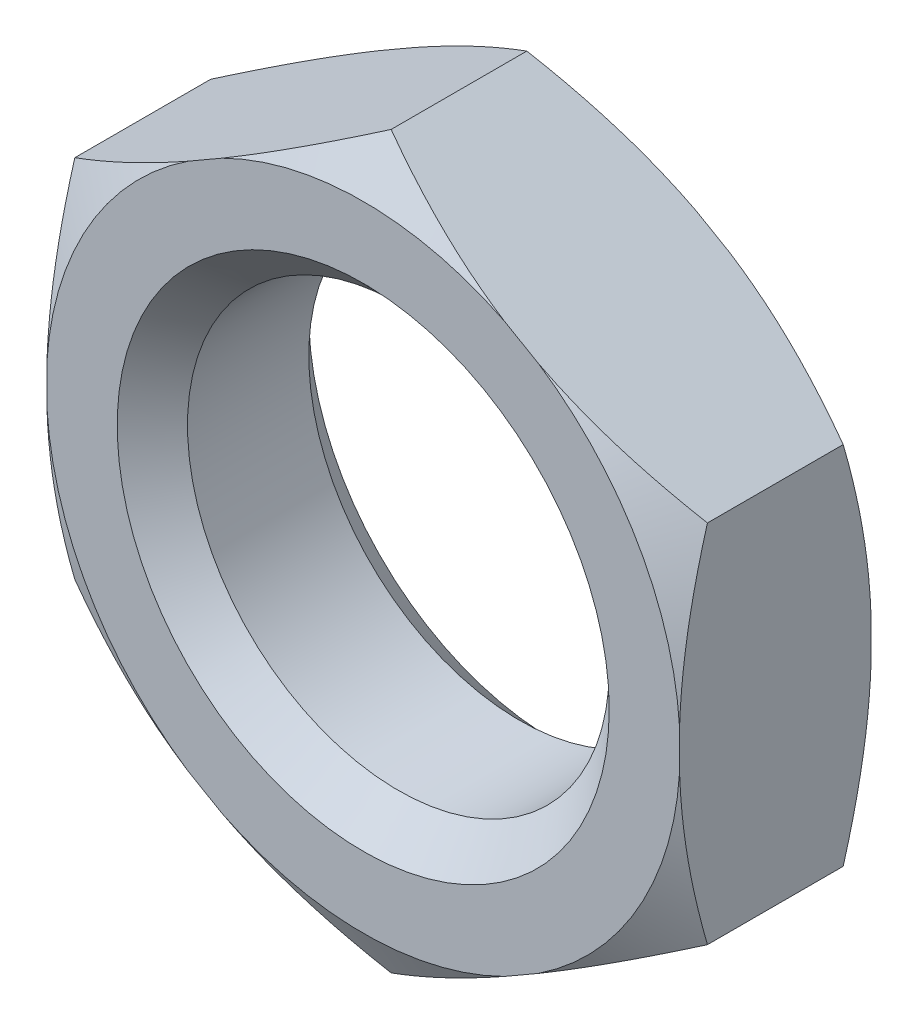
ISO-10303-21;
HEADER;
FILE_DESCRIPTION(('STEP AP214'),'2;1');
FILE_NAME('part.step','',(''),(''),'','','');
FILE_SCHEMA(('AUTOMOTIVE_DESIGN { 1 0 10303 214 1 1 1 1 }'));
ENDSEC;
DATA;
#1=APPLICATION_CONTEXT('core data for automotive mechanical design processes');
#2=APPLICATION_PROTOCOL_DEFINITION('international standard','automotive_design',2000,#1);
#3=PRODUCT_CONTEXT('',#1,'mechanical');
#4=PRODUCT('Part','Part','',(#3));
#5=PRODUCT_RELATED_PRODUCT_CATEGORY('part','',(#4));
#6=PRODUCT_DEFINITION_FORMATION('','',#4);
#7=PRODUCT_DEFINITION_CONTEXT('part definition',#1,'design');
#8=PRODUCT_DEFINITION('design','',#6,#7);
#9=PRODUCT_DEFINITION_SHAPE('','',#8);
#10=(LENGTH_UNIT() NAMED_UNIT(*) SI_UNIT(.MILLI.,.METRE.));
#11=(NAMED_UNIT(*) PLANE_ANGLE_UNIT() SI_UNIT($,.RADIAN.));
#12=(NAMED_UNIT(*) SI_UNIT($,.STERADIAN.) SOLID_ANGLE_UNIT());
#13=UNCERTAINTY_MEASURE_WITH_UNIT(LENGTH_MEASURE(1.E-05),#10,'distance_accuracy_value','');
#14=(GEOMETRIC_REPRESENTATION_CONTEXT(3) GLOBAL_UNCERTAINTY_ASSIGNED_CONTEXT((#13)) GLOBAL_UNIT_ASSIGNED_CONTEXT((#10,
#11,#12)) REPRESENTATION_CONTEXT('',''));
#15=CARTESIAN_POINT('',(0.,0.,0.));
#16=DIRECTION('',(0.,0.,1.));
#17=DIRECTION('',(1.,0.,0.));
#18=AXIS2_PLACEMENT_3D('',#15,#16,#17);
#19=CARTESIAN_POINT('',(18.,10.3923048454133,5.45));
#20=DIRECTION('',(-0.5,-0.866025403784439,0.));
#21=DIRECTION('',(0.866025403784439,-0.5,0.));
#22=AXIS2_PLACEMENT_3D('',#19,#20,#21);
#23=PLANE('',#22);
#24=CARTESIAN_POINT('',(-12.5072979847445,28.0057015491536,1.84601470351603));
#25=CARTESIAN_POINT('',(-12.2245059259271,27.8424314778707,1.69336832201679));
#26=CARTESIAN_POINT('',(-11.9413713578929,27.6789636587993,1.54156855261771));
#27=CARTESIAN_POINT('',(-11.3743571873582,27.3515978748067,1.23982794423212));
#28=CARTESIAN_POINT('',(-11.0904775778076,27.1876999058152,1.08988712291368));
#29=CARTESIAN_POINT('',(-10.2375730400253,26.6952752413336,0.643071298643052));
#30=CARTESIAN_POINT('',(-9.66734821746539,26.36605578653,0.349238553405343));
#31=CARTESIAN_POINT('',(-8.52135894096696,25.7044185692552,-0.229590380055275));
#32=CARTESIAN_POINT('',(-7.94558258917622,25.3719939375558,-0.514555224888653));
#33=CARTESIAN_POINT('',(-6.78971862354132,24.7046555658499,-1.07255585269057));
#34=CARTESIAN_POINT('',(-6.20963114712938,24.3697419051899,-1.34559201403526));
#35=CARTESIAN_POINT('',(-5.02961521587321,23.6884593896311,-1.88388713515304));
#36=CARTESIAN_POINT('',(-4.42955778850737,23.3420160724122,-2.1487707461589));
#37=CARTESIAN_POINT('',(-3.22338644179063,22.6456327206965,-2.65968989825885));
#38=CARTESIAN_POINT('',(-2.61727222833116,22.295692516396,-2.90572451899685));
#39=CARTESIAN_POINT('',(-1.39887283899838,21.5922493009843,-3.37426308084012));
#40=CARTESIAN_POINT('',(-0.786594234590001,21.2387500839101,-3.59678966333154));
#41=CARTESIAN_POINT('',(0.445234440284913,20.5275534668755,-4.01319187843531));
#42=CARTESIAN_POINT('',(1.06478356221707,20.1698566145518,-4.20707120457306));
#43=CARTESIAN_POINT('',(2.11706652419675,19.5623207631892,-4.50497866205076));
#44=CARTESIAN_POINT('',(2.5478528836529,19.313606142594,-4.6181791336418));
#45=CARTESIAN_POINT('',(3.41280827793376,18.8142239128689,-4.82590287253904));
#46=CARTESIAN_POINT('',(3.84697724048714,18.5635563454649,-4.92042653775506));
#47=CARTESIAN_POINT('',(4.71823463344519,18.0605356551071,-5.08866119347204));
#48=CARTESIAN_POINT('',(5.15532227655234,17.8081829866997,-5.16237758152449));
#49=CARTESIAN_POINT('',(6.0319353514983,17.3020701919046,-5.28713533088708));
#50=CARTESIAN_POINT('',(6.47146076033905,17.0483100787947,-5.33817690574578));
#51=CARTESIAN_POINT('',(7.34700899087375,16.542812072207,-5.415674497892));
#52=CARTESIAN_POINT('',(7.78301314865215,16.2910849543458,-5.4424093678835));
#53=CARTESIAN_POINT('',(8.65563191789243,15.787278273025,-5.471506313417));
#54=CARTESIAN_POINT('',(9.09224652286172,15.5351987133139,-5.47386864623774));
#55=CARTESIAN_POINT('',(9.96505640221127,15.03128169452,-5.45414650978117));
#56=CARTESIAN_POINT('',(10.4012516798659,14.7794442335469,-5.43206223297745));
#57=CARTESIAN_POINT('',(11.2722970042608,14.2765459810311,-5.3641152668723));
#58=CARTESIAN_POINT('',(11.7071468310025,14.0254853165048,-5.31824887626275));
#59=CARTESIAN_POINT('',(12.7339573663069,13.43265597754,-5.18302952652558));
#60=CARTESIAN_POINT('',(13.3249590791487,13.0914409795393,-5.08389172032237));
#61=CARTESIAN_POINT('',(14.50131757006,12.4122700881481,-4.84816817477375));
#62=CARTESIAN_POINT('',(15.0866735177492,12.074314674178,-4.7115770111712));
#63=CARTESIAN_POINT('',(16.2516644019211,11.4017068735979,-4.40610220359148));
#64=CARTESIAN_POINT('',(16.8312920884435,11.0670586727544,-4.23718207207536));
#65=CARTESIAN_POINT('',(17.9840453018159,10.4015162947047,-3.8723720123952));
#66=CARTESIAN_POINT('',(18.5571712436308,10.0706218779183,-3.67648381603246));
#67=CARTESIAN_POINT('',(19.7041180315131,9.40843184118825,-3.2599221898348));
#68=CARTESIAN_POINT('',(20.2778652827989,9.0771787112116,-3.03898046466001));
#69=CARTESIAN_POINT('',(21.4192808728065,8.4181821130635,-2.57850814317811));
#70=CARTESIAN_POINT('',(21.9869529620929,8.09043647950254,-2.33898987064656));
#71=CARTESIAN_POINT('',(23.1170889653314,7.43795215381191,-1.84467194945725));
#72=CARTESIAN_POINT('',(23.6795542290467,7.11321268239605,-1.58987639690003));
#73=CARTESIAN_POINT('',(24.8001368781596,6.4662439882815,-1.06763619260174));
#74=CARTESIAN_POINT('',(25.3582536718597,6.14401510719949,-0.800189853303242));
#75=CARTESIAN_POINT('',(26.3025094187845,5.5988487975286,-0.337284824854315));
#76=CARTESIAN_POINT('',(26.6896368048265,5.3753406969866,-0.144503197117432));
#77=CARTESIAN_POINT('',(27.4621851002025,4.92930973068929,0.245525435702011));
#78=CARTESIAN_POINT('',(27.8476060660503,4.7067868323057,0.442772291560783));
#79=CARTESIAN_POINT('',(28.6128368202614,4.26498065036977,0.839088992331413));
#80=CARTESIAN_POINT('',(28.9926627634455,4.04568803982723,1.03811730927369));
#81=CARTESIAN_POINT('',(29.7509618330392,3.60788386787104,1.43960243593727));
#82=CARTESIAN_POINT('',(30.1294349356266,3.38937232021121,1.64205930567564));
#83=CARTESIAN_POINT('',(30.5072979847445,3.17121298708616,1.84601470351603));
#84=B_SPLINE_CURVE_WITH_KNOTS('',3,(#24,#25,#26,#27,#28,#29,#30,#31,#32,#33,#34,#35,#36,#37,#38,
#39,#40,#41,#42,#43,#44,#45,#46,#47,#48,#49,#50,#51,#52,#53,#54,#55,#56,#57,#58,#59,#60,#61,#62,
#63,#64,#65,#66,#67,#68,#69,#70,#71,#72,#73,#74,#75,#76,#77,#78,#79,#80,#81,#82,#83),
.UNSPECIFIED.,.F.,.F.,(4,2,2,2,2,2,2,2,2,2,2,2,2,2,2,2,2,2,2,2,2,2,2,2,2,2,2,2,2,4),(0.,
1.08136929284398,2.16274885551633,4.3257597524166,6.49570389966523,8.66557916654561,
10.8907350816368,13.1159995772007,15.3391009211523,17.5619153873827,19.0920532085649,
20.6221584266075,22.1518663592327,23.6815598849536,25.1934744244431,26.7053730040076,
28.2172596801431,29.7293817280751,31.7969112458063,33.8647403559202,35.9349171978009,
38.004961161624,40.0997509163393,42.1931626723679,44.2860156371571,46.3791485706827,
47.8395678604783,49.2999384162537,50.7448189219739,52.1897247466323),.UNSPECIFIED.);
#85=CARTESIAN_POINT('',(0.,20.7846096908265,-3.86228675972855));
#86=VERTEX_POINT('',#85);
#87=CARTESIAN_POINT('',(8.03285987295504,16.1468358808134,-5.45));
#88=VERTEX_POINT('',#87);
#89=EDGE_CURVE('E177',#86,#88,#84,.T.);
#90=ORIENTED_EDGE('',*,*,#89,.F.);
#91=DIRECTION('',(0.,0.,-1.));
#92=VECTOR('',#91,1.);
#93=CARTESIAN_POINT('',(0.,20.7846096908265,5.45));
#94=LINE('',#93,#92);
#95=CARTESIAN_POINT('',(0.,20.7846096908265,3.86228675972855));
#96=VERTEX_POINT('',#95);
#97=EDGE_CURVE('E223',#96,#86,#94,.T.);
#98=ORIENTED_EDGE('',*,*,#97,.F.);
#99=CARTESIAN_POINT('',(30.5072979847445,3.17121298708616,-1.84601470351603));
#100=CARTESIAN_POINT('',(30.2245059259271,3.33448305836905,-1.69336832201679));
#101=CARTESIAN_POINT('',(29.9413713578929,3.49795087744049,-1.54156855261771));
#102=CARTESIAN_POINT('',(29.3743571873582,3.82531666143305,-1.23982794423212));
#103=CARTESIAN_POINT('',(29.0904775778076,3.98921463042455,-1.08988712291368));
#104=CARTESIAN_POINT('',(28.2375730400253,4.48163929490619,-0.643071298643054));
#105=CARTESIAN_POINT('',(27.6673482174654,4.81085874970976,-0.349238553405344));
#106=CARTESIAN_POINT('',(26.5213589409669,5.47249596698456,0.229590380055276));
#107=CARTESIAN_POINT('',(25.9455825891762,5.80492059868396,0.514555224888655));
#108=CARTESIAN_POINT('',(24.7897186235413,6.47225897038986,1.07255585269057));
#109=CARTESIAN_POINT('',(24.2096311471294,6.80717263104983,1.34559201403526));
#110=CARTESIAN_POINT('',(23.0296152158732,7.48845514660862,1.88388713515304));
#111=CARTESIAN_POINT('',(22.4295577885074,7.83489846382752,2.1487707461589));
#112=CARTESIAN_POINT('',(21.2233864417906,8.53128181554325,2.65968989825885));
#113=CARTESIAN_POINT('',(20.6172722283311,8.88122201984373,2.90572451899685));
#114=CARTESIAN_POINT('',(19.3988728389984,9.58466523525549,3.37426308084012));
#115=CARTESIAN_POINT('',(18.78659423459,9.93816445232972,3.59678966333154));
#116=CARTESIAN_POINT('',(17.5547655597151,10.6493610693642,4.01319187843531));
#117=CARTESIAN_POINT('',(16.9352164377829,11.007057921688,4.20707120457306));
#118=CARTESIAN_POINT('',(15.8829334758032,11.6145937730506,4.50497866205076));
#119=CARTESIAN_POINT('',(15.4521471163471,11.8633083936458,4.6181791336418));
#120=CARTESIAN_POINT('',(14.5871917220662,12.3626906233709,4.82590287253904));
#121=CARTESIAN_POINT('',(14.1530227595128,12.6133581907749,4.92042653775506));
#122=CARTESIAN_POINT('',(13.2817653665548,13.1163788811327,5.08866119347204));
#123=CARTESIAN_POINT('',(12.8446777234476,13.36873154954,5.16237758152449));
#124=CARTESIAN_POINT('',(11.9680646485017,13.8748443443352,5.28713533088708));
#125=CARTESIAN_POINT('',(11.5285392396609,14.1286044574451,5.33817690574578));
#126=CARTESIAN_POINT('',(10.6529910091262,14.6341024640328,5.415674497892));
#127=CARTESIAN_POINT('',(10.2169868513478,14.885829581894,5.4424093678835));
#128=CARTESIAN_POINT('',(9.34436808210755,15.3896362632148,5.471506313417));
#129=CARTESIAN_POINT('',(8.90775347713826,15.6417158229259,5.47386864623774));
#130=CARTESIAN_POINT('',(8.03494359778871,16.1456328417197,5.45414650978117));
#131=CARTESIAN_POINT('',(7.59874832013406,16.3974703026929,5.43206223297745));
#132=CARTESIAN_POINT('',(6.72770299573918,16.9003685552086,5.3641152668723));
#133=CARTESIAN_POINT('',(6.29285316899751,17.151429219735,5.31824887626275));
#134=CARTESIAN_POINT('',(5.26604263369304,17.7442585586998,5.18302952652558));
#135=CARTESIAN_POINT('',(4.67504092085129,18.0854735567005,5.08389172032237));
#136=CARTESIAN_POINT('',(3.49868242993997,18.7646444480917,4.84816817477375));
#137=CARTESIAN_POINT('',(2.9133264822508,19.1025998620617,4.7115770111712));
#138=CARTESIAN_POINT('',(1.7483355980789,19.7752076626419,4.40610220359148));
#139=CARTESIAN_POINT('',(1.16870791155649,20.1098558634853,4.23718207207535));
#140=CARTESIAN_POINT('',(0.0159546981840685,20.7753982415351,3.8723720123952));
#141=CARTESIAN_POINT('',(-0.557171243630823,21.1062926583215,3.67648381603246));
#142=CARTESIAN_POINT('',(-1.70411803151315,21.7684826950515,3.2599221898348));
#143=CARTESIAN_POINT('',(-2.27786528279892,22.0997358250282,3.03898046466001));
#144=CARTESIAN_POINT('',(-3.41928087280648,22.7587324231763,2.57850814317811));
#145=CARTESIAN_POINT('',(-3.98695296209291,23.0864780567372,2.33898987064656));
#146=CARTESIAN_POINT('',(-5.11708896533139,23.7389623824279,1.84467194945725));
#147=CARTESIAN_POINT('',(-5.67955422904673,24.0637018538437,1.58987639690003));
#148=CARTESIAN_POINT('',(-6.80013687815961,24.7106705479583,1.06763619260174));
#149=CARTESIAN_POINT('',(-7.35825367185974,25.0328994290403,0.800189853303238));
#150=CARTESIAN_POINT('',(-8.30250941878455,25.5780657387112,0.337284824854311));
#151=CARTESIAN_POINT('',(-8.6896368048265,25.8015738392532,0.14450319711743));
#152=CARTESIAN_POINT('',(-9.46218510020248,26.2476048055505,-0.245525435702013));
#153=CARTESIAN_POINT('',(-9.84760606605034,26.4701277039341,-0.442772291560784));
#154=CARTESIAN_POINT('',(-10.6128368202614,26.91193388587,-0.839088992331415));
#155=CARTESIAN_POINT('',(-10.9926627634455,27.1312264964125,-1.03811730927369));
#156=CARTESIAN_POINT('',(-11.7509618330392,27.5690306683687,-1.43960243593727));
#157=CARTESIAN_POINT('',(-12.1294349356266,27.7875422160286,-1.64205930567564));
#158=CARTESIAN_POINT('',(-12.5072979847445,28.0057015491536,-1.84601470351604));
#159=B_SPLINE_CURVE_WITH_KNOTS('',3,(#99,#100,#101,#102,#103,#104,#105,#106,#107,#108,#109,#110,
#111,#112,#113,#114,#115,#116,#117,#118,#119,#120,#121,#122,#123,#124,#125,#126,#127,#128,#129,
#130,#131,#132,#133,#134,#135,#136,#137,#138,#139,#140,#141,#142,#143,#144,#145,#146,#147,#148,
#149,#150,#151,#152,#153,#154,#155,#156,#157,#158),.UNSPECIFIED.,.F.,.F.,(4,2,2,2,2,2,2,2,2,2,2,
2,2,2,2,2,2,2,2,2,2,2,2,2,2,2,2,2,2,4),(0.,1.08136929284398,2.16274885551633,4.3257597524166,
6.49570389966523,8.66557916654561,10.8907350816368,13.1159995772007,15.3391009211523,
17.5619153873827,19.0920532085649,20.6221584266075,22.1518663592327,23.6815598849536,
25.1934744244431,26.7053730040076,28.2172596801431,29.7293817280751,31.7969112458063,
33.8647403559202,35.9349171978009,38.004961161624,40.0997509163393,42.1931626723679,
44.2860156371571,46.3791485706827,47.8395678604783,49.2999384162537,50.7448189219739,
52.1897247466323),.UNSPECIFIED.);
#160=CARTESIAN_POINT('',(8.03285987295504,16.1468358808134,5.45));
#161=VERTEX_POINT('',#160);
#162=EDGE_CURVE('E372',#161,#96,#159,.T.);
#163=ORIENTED_EDGE('',*,*,#162,.F.);
#164=DIRECTION('',(-0.866025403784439,0.5,0.));
#165=VECTOR('',#164,1.);
#166=CARTESIAN_POINT('',(18.,10.3923048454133,5.45));
#167=LINE('',#166,#165);
#168=CARTESIAN_POINT('',(9.96714012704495,15.0300786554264,5.45));
#169=VERTEX_POINT('',#168);
#170=EDGE_CURVE('E351',#169,#161,#167,.T.);
#171=ORIENTED_EDGE('',*,*,#170,.F.);
#172=CARTESIAN_POINT('',(18.,10.3923048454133,3.86228675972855));
#173=VERTEX_POINT('',#172);
#174=EDGE_CURVE('E194',#173,#169,#159,.T.);
#175=ORIENTED_EDGE('',*,*,#174,.F.);
#176=DIRECTION('',(0.,0.,-1.));
#177=VECTOR('',#176,1.);
#178=CARTESIAN_POINT('',(18.,10.3923048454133,5.45));
#179=LINE('',#178,#177);
#180=CARTESIAN_POINT('',(18.,10.3923048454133,-3.86228675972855));
#181=VERTEX_POINT('',#180);
#182=EDGE_CURVE('E183',#173,#181,#179,.T.);
#183=ORIENTED_EDGE('',*,*,#182,.T.);
#184=CARTESIAN_POINT('',(9.96714012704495,15.0300786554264,-5.45));
#185=VERTEX_POINT('',#184);
#186=EDGE_CURVE('E164',#185,#181,#84,.T.);
#187=ORIENTED_EDGE('',*,*,#186,.F.);
#188=DIRECTION('',(-0.866025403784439,0.5,0.));
#189=VECTOR('',#188,1.);
#190=CARTESIAN_POINT('',(18.,10.3923048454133,-5.45));
#191=LINE('',#190,#189);
#192=EDGE_CURVE('E265',#185,#88,#191,.T.);
#193=ORIENTED_EDGE('',*,*,#192,.T.);
#194=EDGE_LOOP('',(#90,#98,#163,#171,#175,#183,#187,#193));
#195=FACE_BOUND('',#194,.T.);
#196=ADVANCED_FACE('F39',(#195),#23,.F.);
#197=CARTESIAN_POINT('',(0.,20.7846096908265,5.45));
#198=DIRECTION('',(0.5,-0.866025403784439,0.));
#199=DIRECTION('',(0.866025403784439,0.5,0.));
#200=AXIS2_PLACEMENT_3D('',#197,#198,#199);
#201=PLANE('',#200);
#202=CARTESIAN_POINT('',(-30.5072979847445,3.17121298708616,1.84601470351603));
#203=CARTESIAN_POINT('',(-30.2245059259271,3.33448305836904,1.69336832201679));
#204=CARTESIAN_POINT('',(-29.9413713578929,3.49795087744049,1.54156855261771));
#205=CARTESIAN_POINT('',(-29.3743571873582,3.82531666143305,1.23982794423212));
#206=CARTESIAN_POINT('',(-29.0904775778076,3.98921463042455,1.08988712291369));
#207=CARTESIAN_POINT('',(-28.2375730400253,4.48163929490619,0.643071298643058));
#208=CARTESIAN_POINT('',(-27.6673482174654,4.81085874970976,0.349238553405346));
#209=CARTESIAN_POINT('',(-26.521358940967,5.47249596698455,-0.229590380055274));
#210=CARTESIAN_POINT('',(-25.9455825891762,5.80492059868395,-0.51455522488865));
#211=CARTESIAN_POINT('',(-24.7897186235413,6.47225897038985,-1.07255585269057));
#212=CARTESIAN_POINT('',(-24.2096311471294,6.80717263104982,-1.34559201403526));
#213=CARTESIAN_POINT('',(-23.0296152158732,7.48845514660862,-1.88388713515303));
#214=CARTESIAN_POINT('',(-22.4295577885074,7.83489846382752,-2.1487707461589));
#215=CARTESIAN_POINT('',(-21.2233864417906,8.53128181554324,-2.65968989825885));
#216=CARTESIAN_POINT('',(-20.6172722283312,8.88122201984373,-2.90572451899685));
#217=CARTESIAN_POINT('',(-19.3988728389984,9.58466523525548,-3.37426308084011));
#218=CARTESIAN_POINT('',(-18.78659423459,9.93816445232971,-3.59678966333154));
#219=CARTESIAN_POINT('',(-17.5547655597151,10.6493610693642,-4.0131918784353));
#220=CARTESIAN_POINT('',(-16.9352164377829,11.007057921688,-4.20707120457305));
#221=CARTESIAN_POINT('',(-15.8829334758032,11.6145937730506,-4.50497866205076));
#222=CARTESIAN_POINT('',(-15.4521471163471,11.8633083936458,-4.6181791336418));
#223=CARTESIAN_POINT('',(-14.5871917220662,12.3626906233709,-4.82590287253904));
#224=CARTESIAN_POINT('',(-14.1530227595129,12.6133581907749,-4.92042653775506));
#225=CARTESIAN_POINT('',(-13.2817653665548,13.1163788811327,-5.08866119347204));
#226=CARTESIAN_POINT('',(-12.8446777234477,13.36873154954,-5.16237758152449));
#227=CARTESIAN_POINT('',(-11.9680646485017,13.8748443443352,-5.28713533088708));
#228=CARTESIAN_POINT('',(-11.528539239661,14.1286044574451,-5.33817690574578));
#229=CARTESIAN_POINT('',(-10.6529910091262,14.6341024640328,-5.415674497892));
#230=CARTESIAN_POINT('',(-10.2169868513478,14.885829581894,-5.4424093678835));
#231=CARTESIAN_POINT('',(-9.34436808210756,15.3896362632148,-5.471506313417));
#232=CARTESIAN_POINT('',(-8.90775347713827,15.6417158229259,-5.47386864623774));
#233=CARTESIAN_POINT('',(-8.03494359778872,16.1456328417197,-5.45414650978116));
#234=CARTESIAN_POINT('',(-7.59874832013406,16.3974703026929,-5.43206223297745));
#235=CARTESIAN_POINT('',(-6.72770299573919,16.9003685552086,-5.3641152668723));
#236=CARTESIAN_POINT('',(-6.29285316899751,17.151429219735,-5.31824887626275));
#237=CARTESIAN_POINT('',(-5.26604263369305,17.7442585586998,-5.18302952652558));
#238=CARTESIAN_POINT('',(-4.6750409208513,18.0854735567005,-5.08389172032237));
#239=CARTESIAN_POINT('',(-3.49868242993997,18.7646444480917,-4.84816817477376));
#240=CARTESIAN_POINT('',(-2.91332648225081,19.1025998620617,-4.7115770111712));
#241=CARTESIAN_POINT('',(-1.74833559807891,19.7752076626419,-4.40610220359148));
#242=CARTESIAN_POINT('',(-1.16870791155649,20.1098558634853,-4.23718207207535));
#243=CARTESIAN_POINT('',(-0.0159546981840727,20.7753982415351,-3.8723720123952));
#244=CARTESIAN_POINT('',(0.557171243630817,21.1062926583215,-3.67648381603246));
#245=CARTESIAN_POINT('',(1.70411803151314,21.7684826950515,-3.2599221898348));
#246=CARTESIAN_POINT('',(2.27786528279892,22.0997358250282,-3.03898046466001));
#247=CARTESIAN_POINT('',(3.41928087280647,22.7587324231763,-2.57850814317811));
#248=CARTESIAN_POINT('',(3.9869529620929,23.0864780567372,-2.33898987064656));
#249=CARTESIAN_POINT('',(5.11708896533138,23.7389623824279,-1.84467194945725));
#250=CARTESIAN_POINT('',(5.67955422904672,24.0637018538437,-1.58987639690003));
#251=CARTESIAN_POINT('',(6.8001368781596,24.7106705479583,-1.06763619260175));
#252=CARTESIAN_POINT('',(7.35825367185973,25.0328994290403,-0.800189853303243));
#253=CARTESIAN_POINT('',(8.30250941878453,25.5780657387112,-0.337284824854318));
#254=CARTESIAN_POINT('',(8.68963680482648,25.8015738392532,-0.144503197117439));
#255=CARTESIAN_POINT('',(9.46218510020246,26.2476048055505,0.245525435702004));
#256=CARTESIAN_POINT('',(9.84760606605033,26.4701277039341,0.442772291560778));
#257=CARTESIAN_POINT('',(10.6128368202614,26.91193388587,0.839088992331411));
#258=CARTESIAN_POINT('',(10.9926627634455,27.1312264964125,1.03811730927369));
#259=CARTESIAN_POINT('',(11.7509618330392,27.5690306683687,1.43960243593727));
#260=CARTESIAN_POINT('',(12.1294349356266,27.7875422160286,1.64205930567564));
#261=CARTESIAN_POINT('',(12.5072979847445,28.0057015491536,1.84601470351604));
#262=B_SPLINE_CURVE_WITH_KNOTS('',3,(#202,#203,#204,#205,#206,#207,#208,#209,#210,#211,#212,
#213,#214,#215,#216,#217,#218,#219,#220,#221,#222,#223,#224,#225,#226,#227,#228,#229,#230,#231,
#232,#233,#234,#235,#236,#237,#238,#239,#240,#241,#242,#243,#244,#245,#246,#247,#248,#249,#250,
#251,#252,#253,#254,#255,#256,#257,#258,#259,#260,#261),.UNSPECIFIED.,.F.,.F.,(4,2,2,2,2,2,2,2,
2,2,2,2,2,2,2,2,2,2,2,2,2,2,2,2,2,2,2,2,2,4),(0.,1.08136929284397,2.16274885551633,
4.32575975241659,6.49570389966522,8.6655791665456,10.8907350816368,13.1159995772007,
15.3391009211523,17.5619153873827,19.0920532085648,20.6221584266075,22.1518663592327,
23.6815598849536,25.1934744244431,26.7053730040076,28.2172596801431,29.7293817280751,
31.7969112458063,33.8647403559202,35.9349171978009,38.004961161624,40.0997509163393,
42.1931626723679,44.2860156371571,46.3791485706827,47.8395678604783,49.2999384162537,
50.744818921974,52.1897247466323),.UNSPECIFIED.);
#263=CARTESIAN_POINT('',(-18.,10.3923048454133,-3.86228675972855));
#264=VERTEX_POINT('',#263);
#265=CARTESIAN_POINT('',(-9.96714012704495,15.0300786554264,-5.45));
#266=VERTEX_POINT('',#265);
#267=EDGE_CURVE('E55',#264,#266,#262,.T.);
#268=ORIENTED_EDGE('',*,*,#267,.F.);
#269=DIRECTION('',(0.,0.,-1.));
#270=VECTOR('',#269,1.);
#271=CARTESIAN_POINT('',(-18.,10.3923048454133,5.45));
#272=LINE('',#271,#270);
#273=CARTESIAN_POINT('',(-18.,10.3923048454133,3.86228675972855));
#274=VERTEX_POINT('',#273);
#275=EDGE_CURVE('E219',#274,#264,#272,.T.);
#276=ORIENTED_EDGE('',*,*,#275,.F.);
#277=CARTESIAN_POINT('',(12.5072979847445,28.0057015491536,-1.84601470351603));
#278=CARTESIAN_POINT('',(12.2245059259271,27.8424314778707,-1.69336832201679));
#279=CARTESIAN_POINT('',(11.9413713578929,27.6789636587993,-1.54156855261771));
#280=CARTESIAN_POINT('',(11.3743571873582,27.3515978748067,-1.23982794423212));
#281=CARTESIAN_POINT('',(11.0904775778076,27.1876999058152,-1.08988712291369));
#282=CARTESIAN_POINT('',(10.2375730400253,26.6952752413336,-0.643071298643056));
#283=CARTESIAN_POINT('',(9.6673482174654,26.36605578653,-0.349238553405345));
#284=CARTESIAN_POINT('',(8.52135894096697,25.7044185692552,0.229590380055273));
#285=CARTESIAN_POINT('',(7.94558258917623,25.3719939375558,0.514555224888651));
#286=CARTESIAN_POINT('',(6.78971862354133,24.7046555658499,1.07255585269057));
#287=CARTESIAN_POINT('',(6.20963114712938,24.3697419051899,1.34559201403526));
#288=CARTESIAN_POINT('',(5.02961521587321,23.6884593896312,1.88388713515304));
#289=CARTESIAN_POINT('',(4.42955778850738,23.3420160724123,2.1487707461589));
#290=CARTESIAN_POINT('',(3.22338644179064,22.6456327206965,2.65968989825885));
#291=CARTESIAN_POINT('',(2.61727222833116,22.295692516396,2.90572451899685));
#292=CARTESIAN_POINT('',(1.39887283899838,21.5922493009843,3.37426308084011));
#293=CARTESIAN_POINT('',(0.786594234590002,21.2387500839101,3.59678966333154));
#294=CARTESIAN_POINT('',(-0.445234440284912,20.5275534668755,4.0131918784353));
#295=CARTESIAN_POINT('',(-1.06478356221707,20.1698566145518,4.20707120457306));
#296=CARTESIAN_POINT('',(-2.11706652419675,19.5623207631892,4.50497866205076));
#297=CARTESIAN_POINT('',(-2.5478528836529,19.313606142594,4.6181791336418));
#298=CARTESIAN_POINT('',(-3.41280827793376,18.8142239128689,4.82590287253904));
#299=CARTESIAN_POINT('',(-3.84697724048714,18.5635563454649,4.92042653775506));
#300=CARTESIAN_POINT('',(-4.71823463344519,18.0605356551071,5.08866119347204));
#301=CARTESIAN_POINT('',(-5.15532227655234,17.8081829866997,5.16237758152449));
#302=CARTESIAN_POINT('',(-6.0319353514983,17.3020701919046,5.28713533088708));
#303=CARTESIAN_POINT('',(-6.47146076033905,17.0483100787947,5.33817690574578));
#304=CARTESIAN_POINT('',(-7.34700899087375,16.542812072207,5.415674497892));
#305=CARTESIAN_POINT('',(-7.78301314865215,16.2910849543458,5.4424093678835));
#306=CARTESIAN_POINT('',(-8.65563191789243,15.787278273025,5.471506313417));
#307=CARTESIAN_POINT('',(-9.09224652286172,15.5351987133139,5.47386864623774));
#308=CARTESIAN_POINT('',(-9.96505640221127,15.03128169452,5.45414650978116));
#309=CARTESIAN_POINT('',(-10.4012516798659,14.7794442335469,5.43206223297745));
#310=CARTESIAN_POINT('',(-11.2722970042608,14.2765459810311,5.3641152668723));
#311=CARTESIAN_POINT('',(-11.7071468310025,14.0254853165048,5.31824887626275));
#312=CARTESIAN_POINT('',(-12.7339573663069,13.43265597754,5.18302952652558));
#313=CARTESIAN_POINT('',(-13.3249590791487,13.0914409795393,5.08389172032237));
#314=CARTESIAN_POINT('',(-14.50131757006,12.4122700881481,4.84816817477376));
#315=CARTESIAN_POINT('',(-15.0866735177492,12.074314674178,4.7115770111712));
#316=CARTESIAN_POINT('',(-16.2516644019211,11.4017068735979,4.40610220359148));
#317=CARTESIAN_POINT('',(-16.8312920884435,11.0670586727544,4.23718207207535));
#318=CARTESIAN_POINT('',(-17.9840453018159,10.4015162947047,3.8723720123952));
#319=CARTESIAN_POINT('',(-18.5571712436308,10.0706218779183,3.67648381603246));
#320=CARTESIAN_POINT('',(-19.7041180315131,9.40843184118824,3.2599221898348));
#321=CARTESIAN_POINT('',(-20.2778652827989,9.07717871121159,3.03898046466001));
#322=CARTESIAN_POINT('',(-21.4192808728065,8.41818211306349,2.57850814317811));
#323=CARTESIAN_POINT('',(-21.9869529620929,8.09043647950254,2.33898987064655));
#324=CARTESIAN_POINT('',(-23.1170889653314,7.43795215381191,1.84467194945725));
#325=CARTESIAN_POINT('',(-23.6795542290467,7.11321268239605,1.58987639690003));
#326=CARTESIAN_POINT('',(-24.8001368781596,6.4662439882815,1.06763619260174));
#327=CARTESIAN_POINT('',(-25.3582536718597,6.14401510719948,0.800189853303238));
#328=CARTESIAN_POINT('',(-26.3025094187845,5.5988487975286,0.337284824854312));
#329=CARTESIAN_POINT('',(-26.6896368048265,5.3753406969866,0.144503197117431));
#330=CARTESIAN_POINT('',(-27.4621851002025,4.92930973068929,-0.245525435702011));
#331=CARTESIAN_POINT('',(-27.8476060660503,4.7067868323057,-0.442772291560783));
#332=CARTESIAN_POINT('',(-28.6128368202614,4.26498065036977,-0.839088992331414));
#333=CARTESIAN_POINT('',(-28.9926627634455,4.04568803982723,-1.03811730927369));
#334=CARTESIAN_POINT('',(-29.7509618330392,3.60788386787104,-1.43960243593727));
#335=CARTESIAN_POINT('',(-30.1294349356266,3.38937232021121,-1.64205930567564));
#336=CARTESIAN_POINT('',(-30.5072979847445,3.17121298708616,-1.84601470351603));
#337=B_SPLINE_CURVE_WITH_KNOTS('',3,(#277,#278,#279,#280,#281,#282,#283,#284,#285,#286,#287,
#288,#289,#290,#291,#292,#293,#294,#295,#296,#297,#298,#299,#300,#301,#302,#303,#304,#305,#306,
#307,#308,#309,#310,#311,#312,#313,#314,#315,#316,#317,#318,#319,#320,#321,#322,#323,#324,#325,
#326,#327,#328,#329,#330,#331,#332,#333,#334,#335,#336),.UNSPECIFIED.,.F.,.F.,(4,2,2,2,2,2,2,2,
2,2,2,2,2,2,2,2,2,2,2,2,2,2,2,2,2,2,2,2,2,4),(0.,1.08136929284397,2.16274885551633,
4.32575975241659,6.49570389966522,8.6655791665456,10.8907350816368,13.1159995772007,
15.3391009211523,17.5619153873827,19.0920532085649,20.6221584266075,22.1518663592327,
23.6815598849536,25.1934744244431,26.7053730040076,28.2172596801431,29.7293817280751,
31.7969112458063,33.8647403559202,35.9349171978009,38.004961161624,40.0997509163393,
42.1931626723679,44.2860156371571,46.3791485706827,47.8395678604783,49.2999384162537,
50.7448189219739,52.1897247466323),.UNSPECIFIED.);
#338=CARTESIAN_POINT('',(-9.96714012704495,15.0300786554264,5.45));
#339=VERTEX_POINT('',#338);
#340=EDGE_CURVE('E344',#339,#274,#337,.T.);
#341=ORIENTED_EDGE('',*,*,#340,.F.);
#342=DIRECTION('',(-0.866025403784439,-0.5,0.));
#343=VECTOR('',#342,1.);
#344=CARTESIAN_POINT('',(0.,20.7846096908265,5.45));
#345=LINE('',#344,#343);
#346=CARTESIAN_POINT('',(-8.03285987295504,16.1468358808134,5.45));
#347=VERTEX_POINT('',#346);
#348=EDGE_CURVE('E354',#347,#339,#345,.T.);
#349=ORIENTED_EDGE('',*,*,#348,.F.);
#350=EDGE_CURVE('E350',#96,#347,#337,.T.);
#351=ORIENTED_EDGE('',*,*,#350,.F.);
#352=ORIENTED_EDGE('',*,*,#97,.T.);
#353=CARTESIAN_POINT('',(-8.03285987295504,16.1468358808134,-5.45));
#354=VERTEX_POINT('',#353);
#355=EDGE_CURVE('E421',#354,#86,#262,.T.);
#356=ORIENTED_EDGE('',*,*,#355,.F.);
#357=DIRECTION('',(-0.866025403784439,-0.5,0.));
#358=VECTOR('',#357,1.);
#359=CARTESIAN_POINT('',(0.,20.7846096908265,-5.45));
#360=LINE('',#359,#358);
#361=EDGE_CURVE('E371',#354,#266,#360,.T.);
#362=ORIENTED_EDGE('',*,*,#361,.T.);
#363=EDGE_LOOP('',(#268,#276,#341,#349,#351,#352,#356,#362));
#364=FACE_BOUND('',#363,.T.);
#365=ADVANCED_FACE('F324',(#364),#201,.F.);
#366=CARTESIAN_POINT('',(-18.,10.3923048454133,5.45));
#367=DIRECTION('',(1.,0.,0.));
#368=DIRECTION('',(0.,1.,0.));
#369=AXIS2_PLACEMENT_3D('',#366,#367,#368);
#370=PLANE('',#369);
#371=CARTESIAN_POINT('',(-18.,-22.8996028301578,0.954290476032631));
#372=CARTESIAN_POINT('',(-18.,-22.5744407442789,0.806699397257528));
#373=CARTESIAN_POINT('',(-18.,-22.2488295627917,0.660098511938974));
#374=CARTESIAN_POINT('',(-18.,-21.5966292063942,0.369077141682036));
#375=CARTESIAN_POINT('',(-18.,-21.2700400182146,0.224656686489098));
#376=CARTESIAN_POINT('',(-18.,-20.2885893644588,-0.20507603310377));
#377=CARTESIAN_POINT('',(-18.,-19.6321537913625,-0.486810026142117));
#378=CARTESIAN_POINT('',(-18.,-18.3116874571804,-1.03988782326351));
#379=CARTESIAN_POINT('',(-18.,-17.6476364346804,-1.31118337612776));
#380=CARTESIAN_POINT('',(-18.,-16.313923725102,-1.83958180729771));
#381=CARTESIAN_POINT('',(-18.,-15.6442622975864,-2.09668533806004));
#382=CARTESIAN_POINT('',(-18.,-14.3014937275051,-2.59242814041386));
#383=CARTESIAN_POINT('',(-18.,-13.628415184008,-2.8311444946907));
#384=CARTESIAN_POINT('',(-18.,-12.2750654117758,-3.28750323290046));
#385=CARTESIAN_POINT('',(-18.,-11.5947938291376,-3.50514457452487));
#386=CARTESIAN_POINT('',(-18.,-10.2273780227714,-3.91437334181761));
#387=CARTESIAN_POINT('',(-18.,-9.5402440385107,-4.10599472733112));
#388=CARTESIAN_POINT('',(-18.,-8.15802361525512,-4.45806154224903));
#389=CARTESIAN_POINT('',(-18.,-7.46293830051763,-4.61851132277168));
#390=CARTESIAN_POINT('',(-18.,-6.26309474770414,-4.86218916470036));
#391=CARTESIAN_POINT('',(-18.,-5.76016393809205,-4.95441928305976));
#392=CARTESIAN_POINT('',(-18.,-4.75086267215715,-5.11773573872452));
#393=CARTESIAN_POINT('',(-18.,-4.2444923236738,-5.18882273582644));
#394=CARTESIAN_POINT('',(-18.,-3.22915834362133,-5.30797453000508));
#395=CARTESIAN_POINT('',(-18.,-2.72019539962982,-5.35604513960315));
#396=CARTESIAN_POINT('',(-18.,-1.70053771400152,-5.42779549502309));
#397=CARTESIAN_POINT('',(-18.,-1.18984297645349,-5.45147529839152));
#398=CARTESIAN_POINT('',(-18.,-0.168166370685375,-5.47370568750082));
#399=CARTESIAN_POINT('',(-18.,0.342815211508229,-5.47226929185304));
#400=CARTESIAN_POINT('',(-18.,1.36408355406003,-5.444344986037));
#401=CARTESIAN_POINT('',(-18.,1.87437031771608,-5.41785719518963));
#402=CARTESIAN_POINT('',(-18.,2.89314419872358,-5.34063900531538));
#403=CARTESIAN_POINT('',(-18.,3.40163112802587,-5.2899061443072));
#404=CARTESIAN_POINT('',(-18.,4.41579971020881,-5.16565842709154));
#405=CARTESIAN_POINT('',(-18.,4.92148124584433,-5.09214262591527));
#406=CARTESIAN_POINT('',(-18.,6.18186903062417,-4.88213512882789));
#407=CARTESIAN_POINT('',(-18.,6.93440306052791,-4.73254534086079));
#408=CARTESIAN_POINT('',(-18.,8.43043995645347,-4.39351494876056));
#409=CARTESIAN_POINT('',(-18.,9.17394076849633,-4.20406545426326));
#410=CARTESIAN_POINT('',(-18.,10.653389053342,-3.79202303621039));
#411=CARTESIAN_POINT('',(-18.,11.3893161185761,-3.56935754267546));
#412=CARTESIAN_POINT('',(-18.,12.8524878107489,-3.09751551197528));
#413=CARTESIAN_POINT('',(-18.,13.5797330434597,-2.84834083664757));
#414=CARTESIAN_POINT('',(-18.,15.0348420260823,-2.32569053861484));
#415=CARTESIAN_POINT('',(-18.,15.762616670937,-2.05196836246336));
#416=CARTESIAN_POINT('',(-18.,17.2113545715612,-1.48701321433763));
#417=CARTESIAN_POINT('',(-18.,17.9323173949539,-1.19577913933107));
#418=CARTESIAN_POINT('',(-18.,19.3638902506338,-0.601064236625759));
#419=CARTESIAN_POINT('',(-18.,20.0745368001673,-0.297671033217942));
#420=CARTESIAN_POINT('',(-18.,21.1366966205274,0.165879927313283));
#421=CARTESIAN_POINT('',(-18.,21.4900742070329,0.321788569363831));
#422=CARTESIAN_POINT('',(-18.,22.1956770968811,0.636175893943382));
#423=CARTESIAN_POINT('',(-18.,22.5479024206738,0.794654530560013));
#424=CARTESIAN_POINT('',(-18.,22.8996028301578,0.954290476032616));
#425=B_SPLINE_CURVE_WITH_KNOTS('',3,(#371,#372,#373,#374,#375,#376,#377,#378,#379,#380,#381,
#382,#383,#384,#385,#386,#387,#388,#389,#390,#391,#392,#393,#394,#395,#396,#397,#398,#399,#400,
#401,#402,#403,#404,#405,#406,#407,#408,#409,#410,#411,#412,#413,#414,#415,#416,#417,#418,#419,
#420,#421,#422,#423,#424),.UNSPECIFIED.,.F.,.F.,(4,2,2,2,2,2,2,2,2,2,2,2,2,2,2,2,2,2,2,2,2,2,2,
2,2,2,4),(0.,1.07126790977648,2.14255042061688,4.28547465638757,6.43733910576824,
8.58910454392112,10.7312935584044,12.8735884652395,15.0130599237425,17.1522325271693,
18.6857949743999,20.2193095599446,21.7524366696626,23.2855601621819,24.8178890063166,
26.3502105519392,27.8826877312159,29.4152284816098,31.71561395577,34.0165130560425,
36.3225148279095,38.6283547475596,40.9607175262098,43.2932273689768,45.6112022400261,
46.7699214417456,47.9286199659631),.UNSPECIFIED.);
#426=CARTESIAN_POINT('',(-18.,-10.3923048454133,-3.86228675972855));
#427=VERTEX_POINT('',#426);
#428=CARTESIAN_POINT('',(-18.,-1.11675722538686,-5.45));
#429=VERTEX_POINT('',#428);
#430=EDGE_CURVE('E63',#427,#429,#425,.T.);
#431=ORIENTED_EDGE('',*,*,#430,.F.);
#432=DIRECTION('',(0.,0.,-1.));
#433=VECTOR('',#432,1.);
#434=CARTESIAN_POINT('',(-18.,-10.3923048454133,5.45));
#435=LINE('',#434,#433);
#436=CARTESIAN_POINT('',(-18.,-10.3923048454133,3.86228675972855));
#437=VERTEX_POINT('',#436);
#438=EDGE_CURVE('E215',#437,#427,#435,.T.);
#439=ORIENTED_EDGE('',*,*,#438,.F.);
#440=CARTESIAN_POINT('',(-18.,22.8996028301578,-0.954290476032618));
#441=CARTESIAN_POINT('',(-18.,22.5744407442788,-0.806699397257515));
#442=CARTESIAN_POINT('',(-18.,22.2488295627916,-0.660098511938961));
#443=CARTESIAN_POINT('',(-18.,21.5966292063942,-0.369077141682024));
#444=CARTESIAN_POINT('',(-18.,21.2700400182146,-0.224656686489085));
#445=CARTESIAN_POINT('',(-18.,20.2885893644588,0.205076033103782));
#446=CARTESIAN_POINT('',(-18.,19.6321537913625,0.486810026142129));
#447=CARTESIAN_POINT('',(-18.,18.3116874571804,1.03988782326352));
#448=CARTESIAN_POINT('',(-18.,17.6476364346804,1.31118337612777));
#449=CARTESIAN_POINT('',(-18.,16.3139237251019,1.83958180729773));
#450=CARTESIAN_POINT('',(-18.,15.6442622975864,2.09668533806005));
#451=CARTESIAN_POINT('',(-18.,14.3014937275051,2.59242814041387));
#452=CARTESIAN_POINT('',(-18.,13.628415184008,2.83114449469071));
#453=CARTESIAN_POINT('',(-18.,12.2750654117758,3.28750323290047));
#454=CARTESIAN_POINT('',(-18.,11.5947938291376,3.50514457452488));
#455=CARTESIAN_POINT('',(-18.,10.2273780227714,3.91437334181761));
#456=CARTESIAN_POINT('',(-18.,9.54024403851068,4.10599472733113));
#457=CARTESIAN_POINT('',(-18.,8.1580236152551,4.45806154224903));
#458=CARTESIAN_POINT('',(-18.,7.4629383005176,4.61851132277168));
#459=CARTESIAN_POINT('',(-18.,6.26309474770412,4.86218916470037));
#460=CARTESIAN_POINT('',(-18.,5.76016393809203,4.95441928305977));
#461=CARTESIAN_POINT('',(-18.,4.75086267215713,5.11773573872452));
#462=CARTESIAN_POINT('',(-18.,4.24449232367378,5.18882273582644));
#463=CARTESIAN_POINT('',(-18.,3.22915834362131,5.30797453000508));
#464=CARTESIAN_POINT('',(-18.,2.7201953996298,5.35604513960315));
#465=CARTESIAN_POINT('',(-18.,1.7005377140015,5.42779549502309));
#466=CARTESIAN_POINT('',(-18.,1.18984297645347,5.45147529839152));
#467=CARTESIAN_POINT('',(-18.,0.168166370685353,5.47370568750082));
#468=CARTESIAN_POINT('',(-18.,-0.342815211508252,5.47226929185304));
#469=CARTESIAN_POINT('',(-18.,-1.36408355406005,5.444344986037));
#470=CARTESIAN_POINT('',(-18.,-1.8743703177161,5.41785719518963));
#471=CARTESIAN_POINT('',(-18.,-2.8931441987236,5.34063900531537));
#472=CARTESIAN_POINT('',(-18.,-3.40163112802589,5.2899061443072));
#473=CARTESIAN_POINT('',(-18.,-4.41579971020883,5.16565842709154));
#474=CARTESIAN_POINT('',(-18.,-4.92148124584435,5.09214262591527));
#475=CARTESIAN_POINT('',(-18.,-6.1818690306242,4.88213512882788));
#476=CARTESIAN_POINT('',(-18.,-6.93440306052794,4.73254534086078));
#477=CARTESIAN_POINT('',(-18.,-8.4304399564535,4.39351494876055));
#478=CARTESIAN_POINT('',(-18.,-9.17394076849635,4.20406545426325));
#479=CARTESIAN_POINT('',(-18.,-10.653389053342,3.79202303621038));
#480=CARTESIAN_POINT('',(-18.,-11.3893161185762,3.56935754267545));
#481=CARTESIAN_POINT('',(-18.,-12.8524878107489,3.09751551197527));
#482=CARTESIAN_POINT('',(-18.,-13.5797330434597,2.84834083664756));
#483=CARTESIAN_POINT('',(-18.,-15.0348420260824,2.32569053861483));
#484=CARTESIAN_POINT('',(-18.,-15.7626166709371,2.05196836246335));
#485=CARTESIAN_POINT('',(-18.,-17.2113545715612,1.48701321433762));
#486=CARTESIAN_POINT('',(-18.,-17.9323173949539,1.19577913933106));
#487=CARTESIAN_POINT('',(-18.,-19.3638902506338,0.601064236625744));
#488=CARTESIAN_POINT('',(-18.,-20.0745368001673,0.297671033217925));
#489=CARTESIAN_POINT('',(-18.,-21.1366966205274,-0.165879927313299));
#490=CARTESIAN_POINT('',(-18.,-21.490074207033,-0.321788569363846));
#491=CARTESIAN_POINT('',(-18.,-22.1956770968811,-0.636175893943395));
#492=CARTESIAN_POINT('',(-18.,-22.5479024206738,-0.794654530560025));
#493=CARTESIAN_POINT('',(-18.,-22.8996028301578,-0.954290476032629));
#494=B_SPLINE_CURVE_WITH_KNOTS('',3,(#440,#441,#442,#443,#444,#445,#446,#447,#448,#449,#450,
#451,#452,#453,#454,#455,#456,#457,#458,#459,#460,#461,#462,#463,#464,#465,#466,#467,#468,#469,
#470,#471,#472,#473,#474,#475,#476,#477,#478,#479,#480,#481,#482,#483,#484,#485,#486,#487,#488,
#489,#490,#491,#492,#493),.UNSPECIFIED.,.F.,.F.,(4,2,2,2,2,2,2,2,2,2,2,2,2,2,2,2,2,2,2,2,2,2,2,
2,2,2,4),(0.,1.07126790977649,2.14255042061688,4.28547465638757,6.43733910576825,
8.58910454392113,10.7312935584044,12.8735884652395,15.0130599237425,17.1522325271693,
18.6857949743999,20.2193095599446,21.7524366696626,23.2855601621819,24.8178890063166,
26.3502105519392,27.8826877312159,29.4152284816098,31.71561395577,34.0165130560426,
36.3225148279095,38.6283547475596,40.9607175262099,43.2932273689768,45.6112022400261,
46.7699214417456,47.9286199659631),.UNSPECIFIED.);
#495=CARTESIAN_POINT('',(-18.,-1.11675722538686,5.45));
#496=VERTEX_POINT('',#495);
#497=EDGE_CURVE('E330',#496,#437,#494,.T.);
#498=ORIENTED_EDGE('',*,*,#497,.F.);
#499=DIRECTION('',(0.,-1.,0.));
#500=VECTOR('',#499,1.);
#501=CARTESIAN_POINT('',(-18.,10.3923048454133,5.45));
#502=LINE('',#501,#500);
#503=CARTESIAN_POINT('',(-18.,1.11675722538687,5.45));
#504=VERTEX_POINT('',#503);
#505=EDGE_CURVE('E358',#504,#496,#502,.T.);
#506=ORIENTED_EDGE('',*,*,#505,.F.);
#507=EDGE_CURVE('E337',#274,#504,#494,.T.);
#508=ORIENTED_EDGE('',*,*,#507,.F.);
#509=ORIENTED_EDGE('',*,*,#275,.T.);
#510=CARTESIAN_POINT('',(-18.,1.11675722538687,-5.45));
#511=VERTEX_POINT('',#510);
#512=EDGE_CURVE('E313',#511,#264,#425,.T.);
#513=ORIENTED_EDGE('',*,*,#512,.F.);
#514=DIRECTION('',(0.,-1.,0.));
#515=VECTOR('',#514,1.);
#516=CARTESIAN_POINT('',(-18.,10.3923048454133,-5.45));
#517=LINE('',#516,#515);
#518=EDGE_CURVE('E376',#511,#429,#517,.T.);
#519=ORIENTED_EDGE('',*,*,#518,.T.);
#520=EDGE_LOOP('',(#431,#439,#498,#506,#508,#509,#513,#519));
#521=FACE_BOUND('',#520,.T.);
#522=ADVANCED_FACE('F320',(#521),#370,.F.);
#523=CARTESIAN_POINT('',(-18.,-10.3923048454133,5.45));
#524=DIRECTION('',(0.5,0.866025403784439,0.));
#525=DIRECTION('',(-0.866025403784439,0.5,0.));
#526=AXIS2_PLACEMENT_3D('',#523,#524,#525);
#527=PLANE('',#526);
#528=CARTESIAN_POINT('',(12.5072979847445,-28.0057015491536,1.84601470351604));
#529=CARTESIAN_POINT('',(12.2245059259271,-27.8424314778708,1.69336832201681));
#530=CARTESIAN_POINT('',(11.9413713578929,-27.6789636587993,1.54156855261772));
#531=CARTESIAN_POINT('',(11.3743571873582,-27.3515978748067,1.23982794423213));
#532=CARTESIAN_POINT('',(11.0904775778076,-27.1876999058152,1.08988712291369));
#533=CARTESIAN_POINT('',(10.2375730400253,-26.6952752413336,0.643071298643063));
#534=CARTESIAN_POINT('',(9.66734821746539,-26.36605578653,0.349238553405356));
#535=CARTESIAN_POINT('',(8.52135894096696,-25.7044185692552,-0.229590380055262));
#536=CARTESIAN_POINT('',(7.94558258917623,-25.3719939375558,-0.514555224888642));
#537=CARTESIAN_POINT('',(6.78971862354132,-24.7046555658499,-1.07255585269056));
#538=CARTESIAN_POINT('',(6.20963114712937,-24.36974190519,-1.34559201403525));
#539=CARTESIAN_POINT('',(5.0296152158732,-23.6884593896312,-1.88388713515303));
#540=CARTESIAN_POINT('',(4.42955778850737,-23.3420160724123,-2.14877074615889));
#541=CARTESIAN_POINT('',(3.22338644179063,-22.6456327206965,-2.65968989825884));
#542=CARTESIAN_POINT('',(2.61727222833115,-22.2956925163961,-2.90572451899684));
#543=CARTESIAN_POINT('',(1.39887283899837,-21.5922493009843,-3.37426308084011));
#544=CARTESIAN_POINT('',(0.786594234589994,-21.2387500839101,-3.59678966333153));
#545=CARTESIAN_POINT('',(-0.445234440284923,-20.5275534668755,-4.0131918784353));
#546=CARTESIAN_POINT('',(-1.06478356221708,-20.1698566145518,-4.20707120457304));
#547=CARTESIAN_POINT('',(-2.11706652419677,-19.5623207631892,-4.50497866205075));
#548=CARTESIAN_POINT('',(-2.54785288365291,-19.313606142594,-4.61817913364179));
#549=CARTESIAN_POINT('',(-3.41280827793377,-18.8142239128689,-4.82590287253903));
#550=CARTESIAN_POINT('',(-3.84697724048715,-18.5635563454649,-4.92042653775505));
#551=CARTESIAN_POINT('',(-4.71823463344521,-18.0605356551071,-5.08866119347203));
#552=CARTESIAN_POINT('',(-5.15532227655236,-17.8081829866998,-5.16237758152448));
#553=CARTESIAN_POINT('',(-6.03193535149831,-17.3020701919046,-5.28713533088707));
#554=CARTESIAN_POINT('',(-6.47146076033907,-17.0483100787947,-5.33817690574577));
#555=CARTESIAN_POINT('',(-7.34700899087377,-16.542812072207,-5.41567449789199));
#556=CARTESIAN_POINT('',(-7.78301314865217,-16.2910849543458,-5.44240936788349));
#557=CARTESIAN_POINT('',(-8.65563191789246,-15.787278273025,-5.47150631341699));
#558=CARTESIAN_POINT('',(-9.09224652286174,-15.5351987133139,-5.47386864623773));
#559=CARTESIAN_POINT('',(-9.9650564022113,-15.03128169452,-5.45414650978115));
#560=CARTESIAN_POINT('',(-10.401251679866,-14.7794442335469,-5.43206223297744));
#561=CARTESIAN_POINT('',(-11.2722970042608,-14.2765459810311,-5.36411526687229));
#562=CARTESIAN_POINT('',(-11.7071468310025,-14.0254853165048,-5.31824887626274));
#563=CARTESIAN_POINT('',(-12.733957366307,-13.43265597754,-5.18302952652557));
#564=CARTESIAN_POINT('',(-13.3249590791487,-13.0914409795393,-5.08389172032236));
#565=CARTESIAN_POINT('',(-14.5013175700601,-12.4122700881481,-4.84816817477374));
#566=CARTESIAN_POINT('',(-15.0866735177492,-12.074314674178,-4.71157701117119));
#567=CARTESIAN_POINT('',(-16.2516644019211,-11.4017068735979,-4.40610220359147));
#568=CARTESIAN_POINT('',(-16.8312920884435,-11.0670586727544,-4.23718207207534));
#569=CARTESIAN_POINT('',(-17.984045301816,-10.4015162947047,-3.87237201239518));
#570=CARTESIAN_POINT('',(-18.5571712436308,-10.0706218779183,-3.67648381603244));
#571=CARTESIAN_POINT('',(-19.7041180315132,-9.40843184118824,-3.25992218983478));
#572=CARTESIAN_POINT('',(-20.2778652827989,-9.07717871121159,-3.03898046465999));
#573=CARTESIAN_POINT('',(-21.4192808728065,-8.4181821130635,-2.57850814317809));
#574=CARTESIAN_POINT('',(-21.9869529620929,-8.09043647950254,-2.33898987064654));
#575=CARTESIAN_POINT('',(-23.1170889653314,-7.43795215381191,-1.84467194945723));
#576=CARTESIAN_POINT('',(-23.6795542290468,-7.11321268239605,-1.58987639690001));
#577=CARTESIAN_POINT('',(-24.8001368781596,-6.4662439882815,-1.06763619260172));
#578=CARTESIAN_POINT('',(-25.3582536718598,-6.14401510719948,-0.800189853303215));
#579=CARTESIAN_POINT('',(-26.3025094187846,-5.59884879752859,-0.337284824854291));
#580=CARTESIAN_POINT('',(-26.6896368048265,-5.3753406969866,-0.144503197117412));
#581=CARTESIAN_POINT('',(-27.4621851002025,-4.9293097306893,0.245525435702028));
#582=CARTESIAN_POINT('',(-27.8476060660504,-4.7067868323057,0.4427722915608));
#583=CARTESIAN_POINT('',(-28.6128368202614,-4.26498065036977,0.839088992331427));
#584=CARTESIAN_POINT('',(-28.9926627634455,-4.04568803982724,1.0381173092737));
#585=CARTESIAN_POINT('',(-29.7509618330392,-3.60788386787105,1.43960243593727));
#586=CARTESIAN_POINT('',(-30.1294349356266,-3.38937232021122,1.64205930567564));
#587=CARTESIAN_POINT('',(-30.5072979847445,-3.17121298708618,1.84601470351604));
#588=B_SPLINE_CURVE_WITH_KNOTS('',3,(#528,#529,#530,#531,#532,#533,#534,#535,#536,#537,#538,
#539,#540,#541,#542,#543,#544,#545,#546,#547,#548,#549,#550,#551,#552,#553,#554,#555,#556,#557,
#558,#559,#560,#561,#562,#563,#564,#565,#566,#567,#568,#569,#570,#571,#572,#573,#574,#575,#576,
#577,#578,#579,#580,#581,#582,#583,#584,#585,#586,#587),.UNSPECIFIED.,.F.,.F.,(4,2,2,2,2,2,2,2,
2,2,2,2,2,2,2,2,2,2,2,2,2,2,2,2,2,2,2,2,2,4),(0.,1.08136929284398,2.16274885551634,
4.3257597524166,6.49570389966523,8.6655791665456,10.8907350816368,13.1159995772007,
15.3391009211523,17.5619153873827,19.0920532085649,20.6221584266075,22.1518663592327,
23.6815598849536,25.1934744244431,26.7053730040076,28.2172596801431,29.7293817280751,
31.7969112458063,33.8647403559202,35.9349171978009,38.004961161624,40.0997509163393,
42.193162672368,44.2860156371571,46.3791485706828,47.8395678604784,49.2999384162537,
50.7448189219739,52.1897247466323),.UNSPECIFIED.);
#589=CARTESIAN_POINT('',(0.,-20.7846096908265,-3.86228675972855));
#590=VERTEX_POINT('',#589);
#591=CARTESIAN_POINT('',(-8.03285987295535,-16.1468358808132,-5.45));
#592=VERTEX_POINT('',#591);
#593=EDGE_CURVE('E302',#590,#592,#588,.T.);
#594=ORIENTED_EDGE('',*,*,#593,.F.);
#595=DIRECTION('',(0.,0.,-1.));
#596=VECTOR('',#595,1.);
#597=CARTESIAN_POINT('',(0.,-20.7846096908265,5.45));
#598=LINE('',#597,#596);
#599=CARTESIAN_POINT('',(0.,-20.7846096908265,3.86228675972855));
#600=VERTEX_POINT('',#599);
#601=EDGE_CURVE('E203',#600,#590,#598,.T.);
#602=ORIENTED_EDGE('',*,*,#601,.F.);
#603=CARTESIAN_POINT('',(-30.5072979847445,-3.17121298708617,-1.84601470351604));
#604=CARTESIAN_POINT('',(-30.2245059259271,-3.33448305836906,-1.69336832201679));
#605=CARTESIAN_POINT('',(-29.9413713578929,-3.49795087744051,-1.54156855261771));
#606=CARTESIAN_POINT('',(-29.3743571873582,-3.82531666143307,-1.23982794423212));
#607=CARTESIAN_POINT('',(-29.0904775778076,-3.98921463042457,-1.08988712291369));
#608=CARTESIAN_POINT('',(-28.2375730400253,-4.48163929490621,-0.643071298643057));
#609=CARTESIAN_POINT('',(-27.6673482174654,-4.81085874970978,-0.349238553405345));
#610=CARTESIAN_POINT('',(-26.521358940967,-5.47249596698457,0.229590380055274));
#611=CARTESIAN_POINT('',(-25.9455825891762,-5.80492059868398,0.51455522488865));
#612=CARTESIAN_POINT('',(-24.7897186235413,-6.47225897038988,1.07255585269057));
#613=CARTESIAN_POINT('',(-24.2096311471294,-6.80717263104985,1.34559201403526));
#614=CARTESIAN_POINT('',(-23.0296152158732,-7.48845514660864,1.88388713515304));
#615=CARTESIAN_POINT('',(-22.4295577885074,-7.83489846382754,2.1487707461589));
#616=CARTESIAN_POINT('',(-21.2233864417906,-8.53128181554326,2.65968989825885));
#617=CARTESIAN_POINT('',(-20.6172722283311,-8.88122201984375,2.90572451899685));
#618=CARTESIAN_POINT('',(-19.3988728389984,-9.58466523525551,3.37426308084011));
#619=CARTESIAN_POINT('',(-18.78659423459,-9.93816445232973,3.59678966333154));
#620=CARTESIAN_POINT('',(-17.5547655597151,-10.6493610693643,4.0131918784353));
#621=CARTESIAN_POINT('',(-16.9352164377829,-11.007057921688,4.20707120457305));
#622=CARTESIAN_POINT('',(-15.8829334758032,-11.6145937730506,4.50497866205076));
#623=CARTESIAN_POINT('',(-15.4521471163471,-11.8633083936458,4.61817913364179));
#624=CARTESIAN_POINT('',(-14.5871917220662,-12.3626906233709,4.82590287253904));
#625=CARTESIAN_POINT('',(-14.1530227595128,-12.6133581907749,4.92042653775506));
#626=CARTESIAN_POINT('',(-13.2817653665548,-13.1163788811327,5.08866119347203));
#627=CARTESIAN_POINT('',(-12.8446777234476,-13.3687315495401,5.16237758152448));
#628=CARTESIAN_POINT('',(-11.9680646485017,-13.8748443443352,5.28713533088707));
#629=CARTESIAN_POINT('',(-11.5285392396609,-14.1286044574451,5.33817690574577));
#630=CARTESIAN_POINT('',(-10.6529910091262,-14.6341024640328,5.41567449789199));
#631=CARTESIAN_POINT('',(-10.2169868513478,-14.885829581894,5.44240936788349));
#632=CARTESIAN_POINT('',(-9.34436808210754,-15.3896362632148,5.47150631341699));
#633=CARTESIAN_POINT('',(-8.90775347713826,-15.6417158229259,5.47386864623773));
#634=CARTESIAN_POINT('',(-8.03494359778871,-16.1456328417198,5.45414650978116));
#635=CARTESIAN_POINT('',(-7.59874832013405,-16.3974703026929,5.43206223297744));
#636=CARTESIAN_POINT('',(-6.72770299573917,-16.9003685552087,5.36411526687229));
#637=CARTESIAN_POINT('',(-6.2928531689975,-17.151429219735,5.31824887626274));
#638=CARTESIAN_POINT('',(-5.26604263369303,-17.7442585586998,5.18302952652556));
#639=CARTESIAN_POINT('',(-4.67504092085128,-18.0854735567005,5.08389172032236));
#640=CARTESIAN_POINT('',(-3.49868242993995,-18.7646444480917,4.84816817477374));
#641=CARTESIAN_POINT('',(-2.91332648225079,-19.1025998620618,4.71157701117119));
#642=CARTESIAN_POINT('',(-1.74833559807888,-19.7752076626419,4.40610220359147));
#643=CARTESIAN_POINT('',(-1.16870791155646,-20.1098558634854,4.23718207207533));
#644=CARTESIAN_POINT('',(-0.0159546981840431,-20.7753982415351,3.87237201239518));
#645=CARTESIAN_POINT('',(0.557171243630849,-21.1062926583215,3.67648381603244));
#646=CARTESIAN_POINT('',(1.70411803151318,-21.7684826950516,3.25992218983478));
#647=CARTESIAN_POINT('',(2.27786528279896,-22.0997358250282,3.03898046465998));
#648=CARTESIAN_POINT('',(3.41928087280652,-22.7587324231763,2.57850814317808));
#649=CARTESIAN_POINT('',(3.98695296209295,-23.0864780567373,2.33898987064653));
#650=CARTESIAN_POINT('',(5.11708896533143,-23.7389623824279,1.84467194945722));
#651=CARTESIAN_POINT('',(5.67955422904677,-24.0637018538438,1.5898763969));
#652=CARTESIAN_POINT('',(6.80013687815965,-24.7106705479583,1.06763619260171));
#653=CARTESIAN_POINT('',(7.35825367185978,-25.0328994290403,0.800189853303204));
#654=CARTESIAN_POINT('',(8.30250941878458,-25.5780657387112,0.337284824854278));
#655=CARTESIAN_POINT('',(8.68963680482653,-25.8015738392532,0.144503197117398));
#656=CARTESIAN_POINT('',(9.4621851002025,-26.2476048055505,-0.24552543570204));
#657=CARTESIAN_POINT('',(9.84760606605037,-26.4701277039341,-0.442772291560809));
#658=CARTESIAN_POINT('',(10.6128368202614,-26.91193388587,-0.839088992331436));
#659=CARTESIAN_POINT('',(10.9926627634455,-27.1312264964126,-1.03811730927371));
#660=CARTESIAN_POINT('',(11.7509618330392,-27.5690306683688,-1.43960243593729));
#661=CARTESIAN_POINT('',(12.1294349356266,-27.7875422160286,-1.64205930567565));
#662=CARTESIAN_POINT('',(12.5072979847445,-28.0057015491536,-1.84601470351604));
#663=B_SPLINE_CURVE_WITH_KNOTS('',3,(#603,#604,#605,#606,#607,#608,#609,#610,#611,#612,#613,
#614,#615,#616,#617,#618,#619,#620,#621,#622,#623,#624,#625,#626,#627,#628,#629,#630,#631,#632,
#633,#634,#635,#636,#637,#638,#639,#640,#641,#642,#643,#644,#645,#646,#647,#648,#649,#650,#651,
#652,#653,#654,#655,#656,#657,#658,#659,#660,#661,#662),.UNSPECIFIED.,.F.,.F.,(4,2,2,2,2,2,2,2,
2,2,2,2,2,2,2,2,2,2,2,2,2,2,2,2,2,2,2,2,2,4),(0.,1.08136929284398,2.16274885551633,
4.3257597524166,6.49570389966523,8.66557916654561,10.8907350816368,13.1159995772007,
15.3391009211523,17.5619153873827,19.0920532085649,20.6221584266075,22.1518663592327,
23.6815598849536,25.1934744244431,26.7053730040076,28.2172596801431,29.7293817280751,
31.7969112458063,33.8647403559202,35.9349171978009,38.004961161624,40.0997509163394,
42.193162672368,44.2860156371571,46.3791485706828,47.8395678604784,49.2999384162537,
50.744818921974,52.1897247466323),.UNSPECIFIED.);
#664=CARTESIAN_POINT('',(-8.03285987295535,-16.1468358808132,5.45));
#665=VERTEX_POINT('',#664);
#666=EDGE_CURVE('E339',#665,#600,#663,.T.);
#667=ORIENTED_EDGE('',*,*,#666,.F.);
#668=DIRECTION('',(0.866025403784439,-0.5,0.));
#669=VECTOR('',#668,1.);
#670=CARTESIAN_POINT('',(-18.,-10.3923048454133,5.45));
#671=LINE('',#670,#669);
#672=CARTESIAN_POINT('',(-9.96714012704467,-15.0300786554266,5.45));
#673=VERTEX_POINT('',#672);
#674=EDGE_CURVE('E362',#673,#665,#671,.T.);
#675=ORIENTED_EDGE('',*,*,#674,.F.);
#676=EDGE_CURVE('E338',#437,#673,#663,.T.);
#677=ORIENTED_EDGE('',*,*,#676,.F.);
#678=ORIENTED_EDGE('',*,*,#438,.T.);
#679=CARTESIAN_POINT('',(-9.96714012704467,-15.0300786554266,-5.45));
#680=VERTEX_POINT('',#679);
#681=EDGE_CURVE('E314',#680,#427,#588,.T.);
#682=ORIENTED_EDGE('',*,*,#681,.F.);
#683=DIRECTION('',(0.866025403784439,-0.5,0.));
#684=VECTOR('',#683,1.);
#685=CARTESIAN_POINT('',(-18.,-10.3923048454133,-5.45));
#686=LINE('',#685,#684);
#687=EDGE_CURVE('E380',#680,#592,#686,.T.);
#688=ORIENTED_EDGE('',*,*,#687,.T.);
#689=EDGE_LOOP('',(#594,#602,#667,#675,#677,#678,#682,#688));
#690=FACE_BOUND('',#689,.T.);
#691=ADVANCED_FACE('F323',(#690),#527,.F.);
#692=CARTESIAN_POINT('',(0.,-20.7846096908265,5.45));
#693=DIRECTION('',(-0.5,0.866025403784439,0.));
#694=DIRECTION('',(-0.866025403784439,-0.5,0.));
#695=AXIS2_PLACEMENT_3D('',#692,#693,#694);
#696=PLANE('',#695);
#697=CARTESIAN_POINT('',(30.5072979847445,-3.17121298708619,1.84601470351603));
#698=CARTESIAN_POINT('',(30.2245059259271,-3.33448305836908,1.69336832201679));
#699=CARTESIAN_POINT('',(29.9413713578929,-3.49795087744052,1.54156855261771));
#700=CARTESIAN_POINT('',(29.3743571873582,-3.82531666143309,1.23982794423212));
#701=CARTESIAN_POINT('',(29.0904775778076,-3.98921463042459,1.08988712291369));
#702=CARTESIAN_POINT('',(28.2375730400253,-4.48163929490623,0.643071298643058));
#703=CARTESIAN_POINT('',(27.6673482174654,-4.8108587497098,0.349238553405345));
#704=CARTESIAN_POINT('',(26.5213589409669,-5.47249596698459,-0.229590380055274));
#705=CARTESIAN_POINT('',(25.9455825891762,-5.80492059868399,-0.514555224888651));
#706=CARTESIAN_POINT('',(24.7897186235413,-6.4722589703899,-1.07255585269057));
#707=CARTESIAN_POINT('',(24.2096311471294,-6.80717263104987,-1.34559201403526));
#708=CARTESIAN_POINT('',(23.0296152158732,-7.48845514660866,-1.88388713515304));
#709=CARTESIAN_POINT('',(22.4295577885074,-7.83489846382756,-2.1487707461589));
#710=CARTESIAN_POINT('',(21.2233864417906,-8.53128181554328,-2.65968989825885));
#711=CARTESIAN_POINT('',(20.6172722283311,-8.88122201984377,-2.90572451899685));
#712=CARTESIAN_POINT('',(19.3988728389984,-9.58466523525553,-3.37426308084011));
#713=CARTESIAN_POINT('',(18.78659423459,-9.93816445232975,-3.59678966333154));
#714=CARTESIAN_POINT('',(17.5547655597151,-10.6493610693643,-4.0131918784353));
#715=CARTESIAN_POINT('',(16.9352164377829,-11.007057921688,-4.20707120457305));
#716=CARTESIAN_POINT('',(15.8829334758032,-11.6145937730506,-4.50497866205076));
#717=CARTESIAN_POINT('',(15.4521471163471,-11.8633083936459,-4.61817913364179));
#718=CARTESIAN_POINT('',(14.5871917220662,-12.3626906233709,-4.82590287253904));
#719=CARTESIAN_POINT('',(14.1530227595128,-12.6133581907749,-4.92042653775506));
#720=CARTESIAN_POINT('',(13.2817653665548,-13.1163788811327,-5.08866119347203));
#721=CARTESIAN_POINT('',(12.8446777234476,-13.3687315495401,-5.16237758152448));
#722=CARTESIAN_POINT('',(11.9680646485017,-13.8748443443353,-5.28713533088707));
#723=CARTESIAN_POINT('',(11.5285392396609,-14.1286044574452,-5.33817690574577));
#724=CARTESIAN_POINT('',(10.6529910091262,-14.6341024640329,-5.41567449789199));
#725=CARTESIAN_POINT('',(10.2169868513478,-14.885829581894,-5.44240936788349));
#726=CARTESIAN_POINT('',(9.34436808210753,-15.3896362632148,-5.47150631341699));
#727=CARTESIAN_POINT('',(8.90775347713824,-15.641715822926,-5.47386864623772));
#728=CARTESIAN_POINT('',(8.03494359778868,-16.1456328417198,-5.45414650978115));
#729=CARTESIAN_POINT('',(7.59874832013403,-16.3974703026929,-5.43206223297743));
#730=CARTESIAN_POINT('',(6.72770299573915,-16.9003685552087,-5.36411526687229));
#731=CARTESIAN_POINT('',(6.29285316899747,-17.1514292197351,-5.31824887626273));
#732=CARTESIAN_POINT('',(5.266042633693,-17.7442585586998,-5.18302952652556));
#733=CARTESIAN_POINT('',(4.67504092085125,-18.0854735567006,-5.08389172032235));
#734=CARTESIAN_POINT('',(3.49868242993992,-18.7646444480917,-4.84816817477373));
#735=CARTESIAN_POINT('',(2.91332648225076,-19.1025998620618,-4.71157701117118));
#736=CARTESIAN_POINT('',(1.74833559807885,-19.7752076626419,-4.40610220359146));
#737=CARTESIAN_POINT('',(1.16870791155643,-20.1098558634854,-4.23718207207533));
#738=CARTESIAN_POINT('',(0.0159546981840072,-20.7753982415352,-3.87237201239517));
#739=CARTESIAN_POINT('',(-0.557171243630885,-21.1062926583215,-3.67648381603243));
#740=CARTESIAN_POINT('',(-1.70411803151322,-21.7684826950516,-3.25992218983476));
#741=CARTESIAN_POINT('',(-2.27786528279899,-22.0997358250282,-3.03898046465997));
#742=CARTESIAN_POINT('',(-3.41928087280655,-22.7587324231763,-2.57850814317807));
#743=CARTESIAN_POINT('',(-3.98695296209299,-23.0864780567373,-2.33898987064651));
#744=CARTESIAN_POINT('',(-5.11708896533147,-23.7389623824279,-1.8446719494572));
#745=CARTESIAN_POINT('',(-5.67955422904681,-24.0637018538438,-1.58987639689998));
#746=CARTESIAN_POINT('',(-6.8001368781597,-24.7106705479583,-1.06763619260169));
#747=CARTESIAN_POINT('',(-7.35825367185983,-25.0328994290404,-0.800189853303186));
#748=CARTESIAN_POINT('',(-8.30250941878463,-25.5780657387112,-0.337284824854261));
#749=CARTESIAN_POINT('',(-8.68963680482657,-25.8015738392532,-0.144503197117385));
#750=CARTESIAN_POINT('',(-9.46218510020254,-26.2476048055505,0.245525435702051));
#751=CARTESIAN_POINT('',(-9.84760606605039,-26.4701277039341,0.442772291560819));
#752=CARTESIAN_POINT('',(-10.6128368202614,-26.91193388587,0.839088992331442));
#753=CARTESIAN_POINT('',(-10.9926627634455,-27.1312264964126,1.03811730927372));
#754=CARTESIAN_POINT('',(-11.7509618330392,-27.5690306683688,1.43960243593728));
#755=CARTESIAN_POINT('',(-12.1294349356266,-27.7875422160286,1.64205930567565));
#756=CARTESIAN_POINT('',(-12.5072979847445,-28.0057015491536,1.84601470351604));
#757=B_SPLINE_CURVE_WITH_KNOTS('',3,(#697,#698,#699,#700,#701,#702,#703,#704,#705,#706,#707,
#708,#709,#710,#711,#712,#713,#714,#715,#716,#717,#718,#719,#720,#721,#722,#723,#724,#725,#726,
#727,#728,#729,#730,#731,#732,#733,#734,#735,#736,#737,#738,#739,#740,#741,#742,#743,#744,#745,
#746,#747,#748,#749,#750,#751,#752,#753,#754,#755,#756),.UNSPECIFIED.,.F.,.F.,(4,2,2,2,2,2,2,2,
2,2,2,2,2,2,2,2,2,2,2,2,2,2,2,2,2,2,2,2,2,4),(0.,1.08136929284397,2.16274885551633,
4.3257597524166,6.49570389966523,8.66557916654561,10.8907350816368,13.1159995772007,
15.3391009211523,17.5619153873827,19.0920532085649,20.6221584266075,22.1518663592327,
23.6815598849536,25.1934744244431,26.7053730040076,28.2172596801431,29.7293817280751,
31.7969112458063,33.8647403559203,35.934917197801,38.0049611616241,40.0997509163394,
42.193162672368,44.2860156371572,46.3791485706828,47.8395678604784,49.2999384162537,
50.744818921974,52.1897247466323),.UNSPECIFIED.);
#758=CARTESIAN_POINT('',(18.,-10.3923048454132,-3.86228675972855));
#759=VERTEX_POINT('',#758);
#760=CARTESIAN_POINT('',(9.96714012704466,-15.0300786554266,-5.45));
#761=VERTEX_POINT('',#760);
#762=EDGE_CURVE('E188',#759,#761,#757,.T.);
#763=ORIENTED_EDGE('',*,*,#762,.F.);
#764=DIRECTION('',(0.,0.,-1.));
#765=VECTOR('',#764,1.);
#766=CARTESIAN_POINT('',(18.,-10.3923048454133,5.45));
#767=LINE('',#766,#765);
#768=CARTESIAN_POINT('',(18.,-10.3923048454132,3.86228675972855));
#769=VERTEX_POINT('',#768);
#770=EDGE_CURVE('E196',#769,#759,#767,.T.);
#771=ORIENTED_EDGE('',*,*,#770,.F.);
#772=CARTESIAN_POINT('',(-12.5072979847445,-28.0057015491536,-1.84601470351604));
#773=CARTESIAN_POINT('',(-12.2245059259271,-27.8424314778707,-1.6933683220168));
#774=CARTESIAN_POINT('',(-11.9413713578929,-27.6789636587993,-1.54156855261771));
#775=CARTESIAN_POINT('',(-11.3743571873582,-27.3515978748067,-1.23982794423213));
#776=CARTESIAN_POINT('',(-11.0904775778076,-27.1876999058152,-1.08988712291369));
#777=CARTESIAN_POINT('',(-10.2375730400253,-26.6952752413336,-0.643071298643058));
#778=CARTESIAN_POINT('',(-9.66734821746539,-26.36605578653,-0.349238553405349));
#779=CARTESIAN_POINT('',(-8.52135894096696,-25.7044185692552,0.229590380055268));
#780=CARTESIAN_POINT('',(-7.94558258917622,-25.3719939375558,0.514555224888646));
#781=CARTESIAN_POINT('',(-6.78971862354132,-24.7046555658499,1.07255585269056));
#782=CARTESIAN_POINT('',(-6.20963114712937,-24.36974190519,1.34559201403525));
#783=CARTESIAN_POINT('',(-5.0296152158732,-23.6884593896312,1.88388713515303));
#784=CARTESIAN_POINT('',(-4.42955778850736,-23.3420160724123,2.14877074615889));
#785=CARTESIAN_POINT('',(-3.22338644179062,-22.6456327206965,2.65968989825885));
#786=CARTESIAN_POINT('',(-2.61727222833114,-22.2956925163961,2.90572451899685));
#787=CARTESIAN_POINT('',(-1.39887283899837,-21.5922493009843,3.37426308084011));
#788=CARTESIAN_POINT('',(-0.786594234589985,-21.2387500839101,3.59678966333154));
#789=CARTESIAN_POINT('',(0.445234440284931,-20.5275534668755,4.0131918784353));
#790=CARTESIAN_POINT('',(1.06478356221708,-20.1698566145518,4.20707120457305));
#791=CARTESIAN_POINT('',(2.11706652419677,-19.5623207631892,4.50497866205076));
#792=CARTESIAN_POINT('',(2.54785288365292,-19.313606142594,4.61817913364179));
#793=CARTESIAN_POINT('',(3.41280827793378,-18.8142239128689,4.82590287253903));
#794=CARTESIAN_POINT('',(3.84697724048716,-18.5635563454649,4.92042653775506));
#795=CARTESIAN_POINT('',(4.71823463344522,-18.0605356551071,5.08866119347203));
#796=CARTESIAN_POINT('',(5.15532227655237,-17.8081829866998,5.16237758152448));
#797=CARTESIAN_POINT('',(6.03193535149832,-17.3020701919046,5.28713533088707));
#798=CARTESIAN_POINT('',(6.47146076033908,-17.0483100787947,5.33817690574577));
#799=CARTESIAN_POINT('',(7.34700899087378,-16.542812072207,5.41567449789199));
#800=CARTESIAN_POINT('',(7.78301314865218,-16.2910849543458,5.44240936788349));
#801=CARTESIAN_POINT('',(8.65563191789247,-15.787278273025,5.47150631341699));
#802=CARTESIAN_POINT('',(9.09224652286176,-15.5351987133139,5.47386864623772));
#803=CARTESIAN_POINT('',(9.96505640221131,-15.03128169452,5.45414650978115));
#804=CARTESIAN_POINT('',(10.401251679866,-14.7794442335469,5.43206223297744));
#805=CARTESIAN_POINT('',(11.2722970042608,-14.2765459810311,5.36411526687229));
#806=CARTESIAN_POINT('',(11.7071468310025,-14.0254853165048,5.31824887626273));
#807=CARTESIAN_POINT('',(12.733957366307,-13.43265597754,5.18302952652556));
#808=CARTESIAN_POINT('',(13.3249590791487,-13.0914409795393,5.08389172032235));
#809=CARTESIAN_POINT('',(14.5013175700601,-12.4122700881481,4.84816817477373));
#810=CARTESIAN_POINT('',(15.0866735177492,-12.074314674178,4.71157701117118));
#811=CARTESIAN_POINT('',(16.2516644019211,-11.4017068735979,4.40610220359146));
#812=CARTESIAN_POINT('',(16.8312920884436,-11.0670586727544,4.23718207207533));
#813=CARTESIAN_POINT('',(17.984045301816,-10.4015162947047,3.87237201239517));
#814=CARTESIAN_POINT('',(18.5571712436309,-10.0706218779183,3.67648381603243));
#815=CARTESIAN_POINT('',(19.7041180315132,-9.40843184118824,3.25992218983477));
#816=CARTESIAN_POINT('',(20.277865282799,-9.07717871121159,3.03898046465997));
#817=CARTESIAN_POINT('',(21.4192808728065,-8.41818211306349,2.57850814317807));
#818=CARTESIAN_POINT('',(21.986952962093,-8.09043647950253,2.33898987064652));
#819=CARTESIAN_POINT('',(23.1170889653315,-7.4379521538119,1.84467194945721));
#820=CARTESIAN_POINT('',(23.6795542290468,-7.11321268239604,1.58987639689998));
#821=CARTESIAN_POINT('',(24.8001368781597,-6.46624398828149,1.0676361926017));
#822=CARTESIAN_POINT('',(25.3582536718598,-6.14401510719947,0.800189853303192));
#823=CARTESIAN_POINT('',(26.3025094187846,-5.59884879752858,0.337284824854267));
#824=CARTESIAN_POINT('',(26.6896368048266,-5.37534069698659,0.144503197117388));
#825=CARTESIAN_POINT('',(27.4621851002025,-4.92930973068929,-0.245525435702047));
#826=CARTESIAN_POINT('',(27.8476060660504,-4.70678683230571,-0.442772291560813));
#827=CARTESIAN_POINT('',(28.6128368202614,-4.26498065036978,-0.839088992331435));
#828=CARTESIAN_POINT('',(28.9926627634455,-4.04568803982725,-1.03811730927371));
#829=CARTESIAN_POINT('',(29.7509618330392,-3.60788386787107,-1.43960243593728));
#830=CARTESIAN_POINT('',(30.1294349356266,-3.38937232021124,-1.64205930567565));
#831=CARTESIAN_POINT('',(30.5072979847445,-3.17121298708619,-1.84601470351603));
#832=B_SPLINE_CURVE_WITH_KNOTS('',3,(#772,#773,#774,#775,#776,#777,#778,#779,#780,#781,#782,
#783,#784,#785,#786,#787,#788,#789,#790,#791,#792,#793,#794,#795,#796,#797,#798,#799,#800,#801,
#802,#803,#804,#805,#806,#807,#808,#809,#810,#811,#812,#813,#814,#815,#816,#817,#818,#819,#820,
#821,#822,#823,#824,#825,#826,#827,#828,#829,#830,#831),.UNSPECIFIED.,.F.,.F.,(4,2,2,2,2,2,2,2,
2,2,2,2,2,2,2,2,2,2,2,2,2,2,2,2,2,2,2,2,2,4),(0.,1.08136929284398,2.16274885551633,
4.3257597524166,6.49570389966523,8.66557916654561,10.8907350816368,13.1159995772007,
15.3391009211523,17.5619153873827,19.0920532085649,20.6221584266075,22.1518663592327,
23.6815598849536,25.1934744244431,26.7053730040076,28.2172596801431,29.7293817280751,
31.7969112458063,33.8647403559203,35.934917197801,38.0049611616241,40.0997509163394,
42.193162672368,44.2860156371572,46.3791485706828,47.8395678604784,49.2999384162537,
50.744818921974,52.1897247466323),.UNSPECIFIED.);
#833=CARTESIAN_POINT('',(9.96714012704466,-15.0300786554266,5.45));
#834=VERTEX_POINT('',#833);
#835=EDGE_CURVE('E401',#834,#769,#832,.T.);
#836=ORIENTED_EDGE('',*,*,#835,.F.);
#837=DIRECTION('',(0.866025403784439,0.5,0.));
#838=VECTOR('',#837,1.);
#839=CARTESIAN_POINT('',(0.,-20.7846096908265,5.45));
#840=LINE('',#839,#838);
#841=CARTESIAN_POINT('',(8.03285987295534,-16.1468358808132,5.45));
#842=VERTEX_POINT('',#841);
#843=EDGE_CURVE('E207',#842,#834,#840,.T.);
#844=ORIENTED_EDGE('',*,*,#843,.F.);
#845=EDGE_CURVE('E402',#600,#842,#832,.T.);
#846=ORIENTED_EDGE('',*,*,#845,.F.);
#847=ORIENTED_EDGE('',*,*,#601,.T.);
#848=CARTESIAN_POINT('',(8.03285987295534,-16.1468358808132,-5.45));
#849=VERTEX_POINT('',#848);
#850=EDGE_CURVE('E175',#849,#590,#757,.T.);
#851=ORIENTED_EDGE('',*,*,#850,.F.);
#852=DIRECTION('',(0.866025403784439,0.5,0.));
#853=VECTOR('',#852,1.);
#854=CARTESIAN_POINT('',(0.,-20.7846096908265,-5.45));
#855=LINE('',#854,#853);
#856=EDGE_CURVE('E383',#849,#761,#855,.T.);
#857=ORIENTED_EDGE('',*,*,#856,.T.);
#858=EDGE_LOOP('',(#763,#771,#836,#844,#846,#847,#851,#857));
#859=FACE_BOUND('',#858,.T.);
#860=ADVANCED_FACE('F459',(#859),#696,.F.);
#861=CARTESIAN_POINT('',(18.,-10.3923048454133,5.45));
#862=DIRECTION('',(-1.,0.,0.));
#863=DIRECTION('',(0.,-1.,0.));
#864=AXIS2_PLACEMENT_3D('',#861,#862,#863);
#865=PLANE('',#864);
#866=CARTESIAN_POINT('',(18.,22.8996028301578,0.954290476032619));
#867=CARTESIAN_POINT('',(18.,22.5744407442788,0.80669939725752));
#868=CARTESIAN_POINT('',(18.,22.2488295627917,0.660098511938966));
#869=CARTESIAN_POINT('',(18.,21.5966292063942,0.369077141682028));
#870=CARTESIAN_POINT('',(18.,21.2700400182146,0.224656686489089));
#871=CARTESIAN_POINT('',(18.,20.2885893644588,-0.205076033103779));
#872=CARTESIAN_POINT('',(18.,19.6321537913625,-0.486810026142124));
#873=CARTESIAN_POINT('',(18.,18.3116874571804,-1.03988782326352));
#874=CARTESIAN_POINT('',(18.,17.6476364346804,-1.31118337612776));
#875=CARTESIAN_POINT('',(18.,16.313923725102,-1.83958180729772));
#876=CARTESIAN_POINT('',(18.,15.6442622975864,-2.09668533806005));
#877=CARTESIAN_POINT('',(18.,14.3014937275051,-2.59242814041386));
#878=CARTESIAN_POINT('',(18.,13.628415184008,-2.8311444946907));
#879=CARTESIAN_POINT('',(18.,12.2750654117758,-3.28750323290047));
#880=CARTESIAN_POINT('',(18.,11.5947938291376,-3.50514457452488));
#881=CARTESIAN_POINT('',(18.,10.2273780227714,-3.91437334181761));
#882=CARTESIAN_POINT('',(18.,9.54024403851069,-4.10599472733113));
#883=CARTESIAN_POINT('',(18.,8.15802361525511,-4.45806154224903));
#884=CARTESIAN_POINT('',(18.,7.46293830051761,-4.61851132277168));
#885=CARTESIAN_POINT('',(18.,6.26309474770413,-4.86218916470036));
#886=CARTESIAN_POINT('',(18.,5.76016393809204,-4.95441928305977));
#887=CARTESIAN_POINT('',(18.,4.75086267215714,-5.11773573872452));
#888=CARTESIAN_POINT('',(18.,4.24449232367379,-5.18882273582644));
#889=CARTESIAN_POINT('',(18.,3.22915834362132,-5.30797453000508));
#890=CARTESIAN_POINT('',(18.,2.72019539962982,-5.35604513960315));
#891=CARTESIAN_POINT('',(18.,1.70053771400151,-5.42779549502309));
#892=CARTESIAN_POINT('',(18.,1.18984297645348,-5.45147529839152));
#893=CARTESIAN_POINT('',(18.,0.168166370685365,-5.47370568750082));
#894=CARTESIAN_POINT('',(18.,-0.34281521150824,-5.47226929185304));
#895=CARTESIAN_POINT('',(18.,-1.36408355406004,-5.444344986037));
#896=CARTESIAN_POINT('',(18.,-1.87437031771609,-5.41785719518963));
#897=CARTESIAN_POINT('',(18.,-2.89314419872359,-5.34063900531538));
#898=CARTESIAN_POINT('',(18.,-3.40163112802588,-5.2899061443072));
#899=CARTESIAN_POINT('',(18.,-4.41579971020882,-5.16565842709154));
#900=CARTESIAN_POINT('',(18.,-4.92148124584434,-5.09214262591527));
#901=CARTESIAN_POINT('',(18.,-6.18186903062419,-4.88213512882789));
#902=CARTESIAN_POINT('',(18.,-6.93440306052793,-4.73254534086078));
#903=CARTESIAN_POINT('',(18.,-8.43043995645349,-4.39351494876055));
#904=CARTESIAN_POINT('',(18.,-9.17394076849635,-4.20406545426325));
#905=CARTESIAN_POINT('',(18.,-10.653389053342,-3.79202303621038));
#906=CARTESIAN_POINT('',(18.,-11.3893161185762,-3.56935754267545));
#907=CARTESIAN_POINT('',(18.,-12.8524878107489,-3.09751551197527));
#908=CARTESIAN_POINT('',(18.,-13.5797330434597,-2.84834083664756));
#909=CARTESIAN_POINT('',(18.,-15.0348420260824,-2.32569053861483));
#910=CARTESIAN_POINT('',(18.,-15.7626166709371,-2.05196836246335));
#911=CARTESIAN_POINT('',(18.,-17.2113545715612,-1.48701321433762));
#912=CARTESIAN_POINT('',(18.,-17.9323173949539,-1.19577913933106));
#913=CARTESIAN_POINT('',(18.,-19.3638902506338,-0.60106423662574));
#914=CARTESIAN_POINT('',(18.,-20.0745368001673,-0.29767103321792));
#915=CARTESIAN_POINT('',(18.,-21.1366966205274,0.165879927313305));
#916=CARTESIAN_POINT('',(18.,-21.490074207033,0.321788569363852));
#917=CARTESIAN_POINT('',(18.,-22.1956770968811,0.6361758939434));
#918=CARTESIAN_POINT('',(18.,-22.5479024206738,0.79465453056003));
#919=CARTESIAN_POINT('',(18.,-22.8996028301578,0.954290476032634));
#920=B_SPLINE_CURVE_WITH_KNOTS('',3,(#866,#867,#868,#869,#870,#871,#872,#873,#874,#875,#876,
#877,#878,#879,#880,#881,#882,#883,#884,#885,#886,#887,#888,#889,#890,#891,#892,#893,#894,#895,
#896,#897,#898,#899,#900,#901,#902,#903,#904,#905,#906,#907,#908,#909,#910,#911,#912,#913,#914,
#915,#916,#917,#918,#919),.UNSPECIFIED.,.F.,.F.,(4,2,2,2,2,2,2,2,2,2,2,2,2,2,2,2,2,2,2,2,2,2,2,
2,2,2,4),(0.,1.07126790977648,2.14255042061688,4.28547465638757,6.43733910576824,
8.58910454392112,10.7312935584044,12.8735884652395,15.0130599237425,17.1522325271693,
18.6857949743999,20.2193095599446,21.7524366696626,23.2855601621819,24.8178890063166,
26.3502105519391,27.8826877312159,29.4152284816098,31.71561395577,34.0165130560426,
36.3225148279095,38.6283547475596,40.9607175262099,43.2932273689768,45.6112022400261,
46.7699214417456,47.9286199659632),.UNSPECIFIED.);
#921=CARTESIAN_POINT('',(18.,1.11675722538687,-5.45));
#922=VERTEX_POINT('',#921);
#923=EDGE_CURVE('E167',#181,#922,#920,.T.);
#924=ORIENTED_EDGE('',*,*,#923,.F.);
#925=ORIENTED_EDGE('',*,*,#182,.F.);
#926=CARTESIAN_POINT('',(18.,-22.8996028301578,-0.954290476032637));
#927=CARTESIAN_POINT('',(18.,-22.5744407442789,-0.806699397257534));
#928=CARTESIAN_POINT('',(18.,-22.2488295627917,-0.660098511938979));
#929=CARTESIAN_POINT('',(18.,-21.5966292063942,-0.369077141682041));
#930=CARTESIAN_POINT('',(18.,-21.2700400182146,-0.224656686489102));
#931=CARTESIAN_POINT('',(18.,-20.2885893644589,0.205076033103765));
#932=CARTESIAN_POINT('',(18.,-19.6321537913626,0.486810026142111));
#933=CARTESIAN_POINT('',(18.,-18.3116874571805,1.03988782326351));
#934=CARTESIAN_POINT('',(18.,-17.6476364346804,1.31118337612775));
#935=CARTESIAN_POINT('',(18.,-16.313923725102,1.83958180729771));
#936=CARTESIAN_POINT('',(18.,-15.6442622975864,2.09668533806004));
#937=CARTESIAN_POINT('',(18.,-14.3014937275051,2.59242814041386));
#938=CARTESIAN_POINT('',(18.,-13.628415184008,2.8311444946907));
#939=CARTESIAN_POINT('',(18.,-12.2750654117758,3.28750323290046));
#940=CARTESIAN_POINT('',(18.,-11.5947938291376,3.50514457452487));
#941=CARTESIAN_POINT('',(18.,-10.2273780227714,3.91437334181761));
#942=CARTESIAN_POINT('',(18.,-9.5402440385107,4.10599472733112));
#943=CARTESIAN_POINT('',(18.,-8.15802361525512,4.45806154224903));
#944=CARTESIAN_POINT('',(18.,-7.46293830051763,4.61851132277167));
#945=CARTESIAN_POINT('',(18.,-6.26309474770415,4.86218916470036));
#946=CARTESIAN_POINT('',(18.,-5.76016393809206,4.95441928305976));
#947=CARTESIAN_POINT('',(18.,-4.75086267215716,5.11773573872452));
#948=CARTESIAN_POINT('',(18.,-4.2444923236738,5.18882273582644));
#949=CARTESIAN_POINT('',(18.,-3.22915834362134,5.30797453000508));
#950=CARTESIAN_POINT('',(18.,-2.72019539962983,5.35604513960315));
#951=CARTESIAN_POINT('',(18.,-1.70053771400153,5.42779549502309));
#952=CARTESIAN_POINT('',(18.,-1.1898429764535,5.45147529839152));
#953=CARTESIAN_POINT('',(18.,-0.16816637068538,5.47370568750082));
#954=CARTESIAN_POINT('',(18.,0.342815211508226,5.47226929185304));
#955=CARTESIAN_POINT('',(18.,1.36408355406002,5.444344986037));
#956=CARTESIAN_POINT('',(18.,1.87437031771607,5.41785719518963));
#957=CARTESIAN_POINT('',(18.,2.89314419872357,5.34063900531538));
#958=CARTESIAN_POINT('',(18.,3.40163112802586,5.2899061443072));
#959=CARTESIAN_POINT('',(18.,4.4157997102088,5.16565842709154));
#960=CARTESIAN_POINT('',(18.,4.92148124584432,5.09214262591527));
#961=CARTESIAN_POINT('',(18.,6.18186903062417,4.88213512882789));
#962=CARTESIAN_POINT('',(18.,6.93440306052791,4.73254534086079));
#963=CARTESIAN_POINT('',(18.,8.43043995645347,4.39351494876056));
#964=CARTESIAN_POINT('',(18.,9.17394076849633,4.20406545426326));
#965=CARTESIAN_POINT('',(18.,10.653389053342,3.79202303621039));
#966=CARTESIAN_POINT('',(18.,11.3893161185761,3.56935754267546));
#967=CARTESIAN_POINT('',(18.,12.8524878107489,3.09751551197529));
#968=CARTESIAN_POINT('',(18.,13.5797330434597,2.84834083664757));
#969=CARTESIAN_POINT('',(18.,15.0348420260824,2.32569053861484));
#970=CARTESIAN_POINT('',(18.,15.7626166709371,2.05196836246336));
#971=CARTESIAN_POINT('',(18.,17.2113545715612,1.48701321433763));
#972=CARTESIAN_POINT('',(18.,17.9323173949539,1.19577913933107));
#973=CARTESIAN_POINT('',(18.,19.3638902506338,0.601064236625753));
#974=CARTESIAN_POINT('',(18.,20.0745368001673,0.297671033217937));
#975=CARTESIAN_POINT('',(18.,21.1366966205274,-0.165879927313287));
#976=CARTESIAN_POINT('',(18.,21.490074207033,-0.321788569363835));
#977=CARTESIAN_POINT('',(18.,22.1956770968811,-0.636175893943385));
#978=CARTESIAN_POINT('',(18.,22.5479024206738,-0.794654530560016));
#979=CARTESIAN_POINT('',(18.,22.8996028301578,-0.95429047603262));
#980=B_SPLINE_CURVE_WITH_KNOTS('',3,(#926,#927,#928,#929,#930,#931,#932,#933,#934,#935,#936,
#937,#938,#939,#940,#941,#942,#943,#944,#945,#946,#947,#948,#949,#950,#951,#952,#953,#954,#955,
#956,#957,#958,#959,#960,#961,#962,#963,#964,#965,#966,#967,#968,#969,#970,#971,#972,#973,#974,
#975,#976,#977,#978,#979),.UNSPECIFIED.,.F.,.F.,(4,2,2,2,2,2,2,2,2,2,2,2,2,2,2,2,2,2,2,2,2,2,2,
2,2,2,4),(0.,1.07126790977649,2.14255042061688,4.28547465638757,6.43733910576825,
8.58910454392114,10.7312935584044,12.8735884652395,15.0130599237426,17.1522325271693,
18.6857949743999,20.2193095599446,21.7524366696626,23.2855601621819,24.8178890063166,
26.3502105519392,27.8826877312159,29.4152284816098,31.71561395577,34.0165130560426,
36.3225148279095,38.6283547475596,40.9607175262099,43.2932273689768,45.6112022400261,
46.7699214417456,47.9286199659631),.UNSPECIFIED.);
#981=CARTESIAN_POINT('',(18.,1.11675722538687,5.45));
#982=VERTEX_POINT('',#981);
#983=EDGE_CURVE('E399',#982,#173,#980,.T.);
#984=ORIENTED_EDGE('',*,*,#983,.F.);
#985=DIRECTION('',(0.,1.,0.));
#986=VECTOR('',#985,1.);
#987=CARTESIAN_POINT('',(18.,-10.3923048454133,5.45));
#988=LINE('',#987,#986);
#989=CARTESIAN_POINT('',(18.,-1.11675722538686,5.45));
#990=VERTEX_POINT('',#989);
#991=EDGE_CURVE('E197',#990,#982,#988,.T.);
#992=ORIENTED_EDGE('',*,*,#991,.F.);
#993=EDGE_CURVE('E398',#769,#990,#980,.T.);
#994=ORIENTED_EDGE('',*,*,#993,.F.);
#995=ORIENTED_EDGE('',*,*,#770,.T.);
#996=CARTESIAN_POINT('',(18.,-1.11675722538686,-5.45));
#997=VERTEX_POINT('',#996);
#998=EDGE_CURVE('E190',#997,#759,#920,.T.);
#999=ORIENTED_EDGE('',*,*,#998,.F.);
#1000=DIRECTION('',(0.,1.,0.));
#1001=VECTOR('',#1000,1.);
#1002=CARTESIAN_POINT('',(18.,-10.3923048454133,-5.45));
#1003=LINE('',#1002,#1001);
#1004=EDGE_CURVE('E186',#997,#922,#1003,.T.);
#1005=ORIENTED_EDGE('',*,*,#1004,.T.);
#1006=EDGE_LOOP('',(#924,#925,#984,#992,#994,#995,#999,#1005));
#1007=FACE_BOUND('',#1006,.T.);
#1008=ADVANCED_FACE('F181',(#1007),#865,.F.);
#1009=CARTESIAN_POINT('',(0.,0.,-5.45));
#1010=DIRECTION('',(0.,0.,1.));
#1011=DIRECTION('',(1.,0.,0.));
#1012=AXIS2_PLACEMENT_3D('',#1009,#1010,#1011);
#1013=PLANE('',#1012);
#1014=CARTESIAN_POINT('',(0.,0.,-5.45));
#1015=DIRECTION('',(0.,0.,1.));
#1016=DIRECTION('',(1.,0.,0.));
#1017=AXIS2_PLACEMENT_3D('',#1014,#1015,#1016);
#1018=CIRCLE('',#1017,14.);
#1019=CARTESIAN_POINT('',(14.,0.,-5.45));
#1020=VERTEX_POINT('',#1019);
#1021=EDGE_CURVE('E238',#1020,#1020,#1018,.T.);
#1022=ORIENTED_EDGE('',*,*,#1021,.T.);
#1023=EDGE_LOOP('',(#1022));
#1024=FACE_BOUND('',#1023,.T.);
#1025=CARTESIAN_POINT('',(0.,0.,-5.45));
#1026=DIRECTION('',(0.,0.,1.));
#1027=DIRECTION('',(1.,0.,0.));
#1028=AXIS2_PLACEMENT_3D('',#1025,#1026,#1027);
#1029=CIRCLE('',#1028,18.0346096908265);
#1030=EDGE_CURVE('E169',#922,#185,#1029,.T.);
#1031=ORIENTED_EDGE('',*,*,#1030,.F.);
#1032=ORIENTED_EDGE('',*,*,#1004,.F.);
#1033=CARTESIAN_POINT('',(0.,0.,-5.45));
#1034=DIRECTION('',(0.,0.,1.));
#1035=DIRECTION('',(1.,0.,0.));
#1036=AXIS2_PLACEMENT_3D('',#1033,#1034,#1035);
#1037=CIRCLE('',#1036,18.0346096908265);
#1038=EDGE_CURVE('E233',#761,#997,#1037,.T.);
#1039=ORIENTED_EDGE('',*,*,#1038,.F.);
#1040=ORIENTED_EDGE('',*,*,#856,.F.);
#1041=EDGE_CURVE('E236',#592,#849,#1037,.T.);
#1042=ORIENTED_EDGE('',*,*,#1041,.F.);
#1043=ORIENTED_EDGE('',*,*,#687,.F.);
#1044=EDGE_CURVE('E394',#429,#680,#1037,.T.);
#1045=ORIENTED_EDGE('',*,*,#1044,.F.);
#1046=ORIENTED_EDGE('',*,*,#518,.F.);
#1047=EDGE_CURVE('E415',#266,#511,#1037,.T.);
#1048=ORIENTED_EDGE('',*,*,#1047,.F.);
#1049=ORIENTED_EDGE('',*,*,#361,.F.);
#1050=EDGE_CURVE('E237',#88,#354,#1037,.T.);
#1051=ORIENTED_EDGE('',*,*,#1050,.F.);
#1052=ORIENTED_EDGE('',*,*,#192,.F.);
#1053=EDGE_LOOP('',(#1031,#1032,#1039,#1040,#1042,#1043,#1045,#1046,#1048,#1049,#1051,#1052));
#1054=FACE_BOUND('',#1053,.T.);
#1055=ADVANCED_FACE('F258',(#1024,#1054),#1013,.F.);
#1056=CARTESIAN_POINT('',(0.,0.,5.45));
#1057=DIRECTION('',(0.,0.,1.));
#1058=DIRECTION('',(1.,0.,0.));
#1059=AXIS2_PLACEMENT_3D('',#1056,#1057,#1058);
#1060=PLANE('',#1059);
#1061=CARTESIAN_POINT('',(0.,0.,5.45));
#1062=DIRECTION('',(0.,0.,1.));
#1063=DIRECTION('',(1.,0.,0.));
#1064=AXIS2_PLACEMENT_3D('',#1061,#1062,#1063);
#1065=CIRCLE('',#1064,14.);
#1066=CARTESIAN_POINT('',(14.,0.,5.45));
#1067=VERTEX_POINT('',#1066);
#1068=EDGE_CURVE('E11',#1067,#1067,#1065,.F.);
#1069=ORIENTED_EDGE('',*,*,#1068,.T.);
#1070=EDGE_LOOP('',(#1069));
#1071=FACE_BOUND('',#1070,.T.);
#1072=ORIENTED_EDGE('',*,*,#991,.T.);
#1073=CARTESIAN_POINT('',(0.,0.,5.45));
#1074=DIRECTION('',(0.,0.,1.));
#1075=DIRECTION('',(1.,0.,0.));
#1076=AXIS2_PLACEMENT_3D('',#1073,#1074,#1075);
#1077=CIRCLE('',#1076,18.0346096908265);
#1078=EDGE_CURVE('E466',#982,#169,#1077,.T.);
#1079=ORIENTED_EDGE('',*,*,#1078,.T.);
#1080=ORIENTED_EDGE('',*,*,#170,.T.);
#1081=CARTESIAN_POINT('',(0.,0.,5.45));
#1082=DIRECTION('',(0.,0.,1.));
#1083=DIRECTION('',(1.,0.,0.));
#1084=AXIS2_PLACEMENT_3D('',#1081,#1082,#1083);
#1085=CIRCLE('',#1084,18.0346096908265);
#1086=EDGE_CURVE('E232',#161,#347,#1085,.T.);
#1087=ORIENTED_EDGE('',*,*,#1086,.T.);
#1088=ORIENTED_EDGE('',*,*,#348,.T.);
#1089=EDGE_CURVE('E408',#339,#504,#1085,.T.);
#1090=ORIENTED_EDGE('',*,*,#1089,.T.);
#1091=ORIENTED_EDGE('',*,*,#505,.T.);
#1092=EDGE_CURVE('E405',#496,#673,#1085,.T.);
#1093=ORIENTED_EDGE('',*,*,#1092,.T.);
#1094=ORIENTED_EDGE('',*,*,#674,.T.);
#1095=EDGE_CURVE('E231',#665,#842,#1085,.T.);
#1096=ORIENTED_EDGE('',*,*,#1095,.T.);
#1097=ORIENTED_EDGE('',*,*,#843,.T.);
#1098=EDGE_CURVE('E227',#834,#990,#1085,.T.);
#1099=ORIENTED_EDGE('',*,*,#1098,.T.);
#1100=EDGE_LOOP('',(#1072,#1079,#1080,#1087,#1088,#1090,#1091,#1093,#1094,#1096,#1097,#1099));
#1101=FACE_BOUND('',#1100,.T.);
#1102=ADVANCED_FACE('F261',(#1071,#1101),#1060,.T.);
#1103=CARTESIAN_POINT('',(0.,0.,5.45));
#1104=DIRECTION('',(0.,0.,-1.));
#1105=DIRECTION('',(-1.,0.,0.));
#1106=AXIS2_PLACEMENT_3D('',#1103,#1104,#1105);
#1107=CONICAL_SURFACE('',#1106,18.0346096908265,1.0471975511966);
#1108=ORIENTED_EDGE('',*,*,#835,.T.);
#1109=ORIENTED_EDGE('',*,*,#993,.T.);
#1110=ORIENTED_EDGE('',*,*,#1098,.F.);
#1111=EDGE_LOOP('',(#1108,#1109,#1110));
#1112=FACE_BOUND('',#1111,.T.);
#1113=ADVANCED_FACE('F463',(#1112),#1107,.T.);
#1114=ORIENTED_EDGE('',*,*,#666,.T.);
#1115=ORIENTED_EDGE('',*,*,#845,.T.);
#1116=ORIENTED_EDGE('',*,*,#1095,.F.);
#1117=EDGE_LOOP('',(#1114,#1115,#1116));
#1118=FACE_BOUND('',#1117,.T.);
#1119=ADVANCED_FACE('F518',(#1118),#1107,.T.);
#1120=ORIENTED_EDGE('',*,*,#497,.T.);
#1121=ORIENTED_EDGE('',*,*,#676,.T.);
#1122=ORIENTED_EDGE('',*,*,#1092,.F.);
#1123=EDGE_LOOP('',(#1120,#1121,#1122));
#1124=FACE_BOUND('',#1123,.T.);
#1125=ADVANCED_FACE('F447',(#1124),#1107,.T.);
#1126=ORIENTED_EDGE('',*,*,#340,.T.);
#1127=ORIENTED_EDGE('',*,*,#507,.T.);
#1128=ORIENTED_EDGE('',*,*,#1089,.F.);
#1129=EDGE_LOOP('',(#1126,#1127,#1128));
#1130=FACE_BOUND('',#1129,.T.);
#1131=ADVANCED_FACE('F437',(#1130),#1107,.T.);
#1132=ORIENTED_EDGE('',*,*,#162,.T.);
#1133=ORIENTED_EDGE('',*,*,#350,.T.);
#1134=ORIENTED_EDGE('',*,*,#1086,.F.);
#1135=EDGE_LOOP('',(#1132,#1133,#1134));
#1136=FACE_BOUND('',#1135,.T.);
#1137=ADVANCED_FACE('F288',(#1136),#1107,.T.);
#1138=ORIENTED_EDGE('',*,*,#174,.T.);
#1139=ORIENTED_EDGE('',*,*,#1078,.F.);
#1140=ORIENTED_EDGE('',*,*,#983,.T.);
#1141=EDGE_LOOP('',(#1138,#1139,#1140));
#1142=FACE_BOUND('',#1141,.T.);
#1143=ADVANCED_FACE('F519',(#1142),#1107,.T.);
#1144=CARTESIAN_POINT('',(0.,0.,-5.45));
#1145=DIRECTION('',(0.,0.,1.));
#1146=DIRECTION('',(-1.,0.,0.));
#1147=AXIS2_PLACEMENT_3D('',#1144,#1145,#1146);
#1148=CONICAL_SURFACE('',#1147,18.0346096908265,1.0471975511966);
#1149=ORIENTED_EDGE('',*,*,#762,.T.);
#1150=ORIENTED_EDGE('',*,*,#1038,.T.);
#1151=ORIENTED_EDGE('',*,*,#998,.T.);
#1152=EDGE_LOOP('',(#1149,#1150,#1151));
#1153=FACE_BOUND('',#1152,.T.);
#1154=ADVANCED_FACE('F287',(#1153),#1148,.T.);
#1155=ORIENTED_EDGE('',*,*,#593,.T.);
#1156=ORIENTED_EDGE('',*,*,#1041,.T.);
#1157=ORIENTED_EDGE('',*,*,#850,.T.);
#1158=EDGE_LOOP('',(#1155,#1156,#1157));
#1159=FACE_BOUND('',#1158,.T.);
#1160=ADVANCED_FACE('F544',(#1159),#1148,.T.);
#1161=ORIENTED_EDGE('',*,*,#430,.T.);
#1162=ORIENTED_EDGE('',*,*,#1044,.T.);
#1163=ORIENTED_EDGE('',*,*,#681,.T.);
#1164=EDGE_LOOP('',(#1161,#1162,#1163));
#1165=FACE_BOUND('',#1164,.T.);
#1166=ADVANCED_FACE('F550',(#1165),#1148,.T.);
#1167=ORIENTED_EDGE('',*,*,#267,.T.);
#1168=ORIENTED_EDGE('',*,*,#1047,.T.);
#1169=ORIENTED_EDGE('',*,*,#512,.T.);
#1170=EDGE_LOOP('',(#1167,#1168,#1169));
#1171=FACE_BOUND('',#1170,.T.);
#1172=ADVANCED_FACE('F285',(#1171),#1148,.T.);
#1173=ORIENTED_EDGE('',*,*,#89,.T.);
#1174=ORIENTED_EDGE('',*,*,#1050,.T.);
#1175=ORIENTED_EDGE('',*,*,#355,.T.);
#1176=EDGE_LOOP('',(#1173,#1174,#1175));
#1177=FACE_BOUND('',#1176,.T.);
#1178=ADVANCED_FACE('F280',(#1177),#1148,.T.);
#1179=ORIENTED_EDGE('',*,*,#186,.T.);
#1180=ORIENTED_EDGE('',*,*,#923,.T.);
#1181=ORIENTED_EDGE('',*,*,#1030,.T.);
#1182=EDGE_LOOP('',(#1179,#1180,#1181));
#1183=FACE_BOUND('',#1182,.T.);
#1184=ADVANCED_FACE('F166',(#1183),#1148,.T.);
#1185=CARTESIAN_POINT('',(0.,0.,-5.45));
#1186=DIRECTION('',(0.,0.,1.));
#1187=DIRECTION('',(1.,0.,0.));
#1188=AXIS2_PLACEMENT_3D('',#1185,#1186,#1187);
#1189=CYLINDRICAL_SURFACE('',#1188,12.);
#1190=CARTESIAN_POINT('',(0.,0.,-3.45));
#1191=DIRECTION('',(0.,0.,1.));
#1192=DIRECTION('',(1.,0.,0.));
#1193=AXIS2_PLACEMENT_3D('',#1190,#1191,#1192);
#1194=CIRCLE('',#1193,12.);
#1195=CARTESIAN_POINT('',(12.,0.,-3.45));
#1196=VERTEX_POINT('',#1195);
#1197=EDGE_CURVE('E48',#1196,#1196,#1194,.F.);
#1198=ORIENTED_EDGE('',*,*,#1197,.T.);
#1199=EDGE_LOOP('',(#1198));
#1200=FACE_BOUND('',#1199,.T.);
#1201=CARTESIAN_POINT('',(0.,0.,3.45000000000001));
#1202=DIRECTION('',(0.,0.,1.));
#1203=DIRECTION('',(1.,0.,0.));
#1204=AXIS2_PLACEMENT_3D('',#1201,#1202,#1203);
#1205=CIRCLE('',#1204,12.);
#1206=CARTESIAN_POINT('',(12.,0.,3.45000000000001));
#1207=VERTEX_POINT('',#1206);
#1208=EDGE_CURVE('E242',#1207,#1207,#1205,.T.);
#1209=ORIENTED_EDGE('',*,*,#1208,.T.);
#1210=EDGE_LOOP('',(#1209));
#1211=FACE_BOUND('',#1210,.T.);
#1212=ADVANCED_FACE('F250',(#1200,#1211),#1189,.F.);
#1213=CARTESIAN_POINT('',(0.,0.,-5.45));
#1214=DIRECTION('',(0.,0.,-1.));
#1215=DIRECTION('',(-1.,0.,0.));
#1216=AXIS2_PLACEMENT_3D('',#1213,#1214,#1215);
#1217=CONICAL_SURFACE('',#1216,14.,0.785398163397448);
#1218=ORIENTED_EDGE('',*,*,#1197,.F.);
#1219=EDGE_LOOP('',(#1218));
#1220=FACE_BOUND('',#1219,.T.);
#1221=ORIENTED_EDGE('',*,*,#1021,.F.);
#1222=EDGE_LOOP('',(#1221));
#1223=FACE_BOUND('',#1222,.T.);
#1224=ADVANCED_FACE('F253',(#1220,#1223),#1217,.F.);
#1225=CARTESIAN_POINT('',(0.,0.,3.45000000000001));
#1226=DIRECTION('',(0.,0.,1.));
#1227=DIRECTION('',(1.,0.,0.));
#1228=AXIS2_PLACEMENT_3D('',#1225,#1226,#1227);
#1229=CONICAL_SURFACE('',#1228,12.,0.785398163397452);
#1230=ORIENTED_EDGE('',*,*,#1068,.F.);
#1231=EDGE_LOOP('',(#1230));
#1232=FACE_BOUND('',#1231,.T.);
#1233=ORIENTED_EDGE('',*,*,#1208,.F.);
#1234=EDGE_LOOP('',(#1233));
#1235=FACE_BOUND('',#1234,.T.);
#1236=ADVANCED_FACE('F41',(#1232,#1235),#1229,.F.);
#1237=CLOSED_SHELL('',(#196,#365,#522,#691,#860,#1008,#1055,#1102,#1113,#1119,#1125,#1131,#1137,
#1143,#1154,#1160,#1166,#1172,#1178,#1184,#1212,#1224,#1236));
#1238=MANIFOLD_SOLID_BREP('B2',#1237);
#1239=ADVANCED_BREP_SHAPE_REPRESENTATION('',(#18,#1238),#14);
#1240=SHAPE_DEFINITION_REPRESENTATION(#9,#1239);
ENDSEC;
END-ISO-10303-21;
